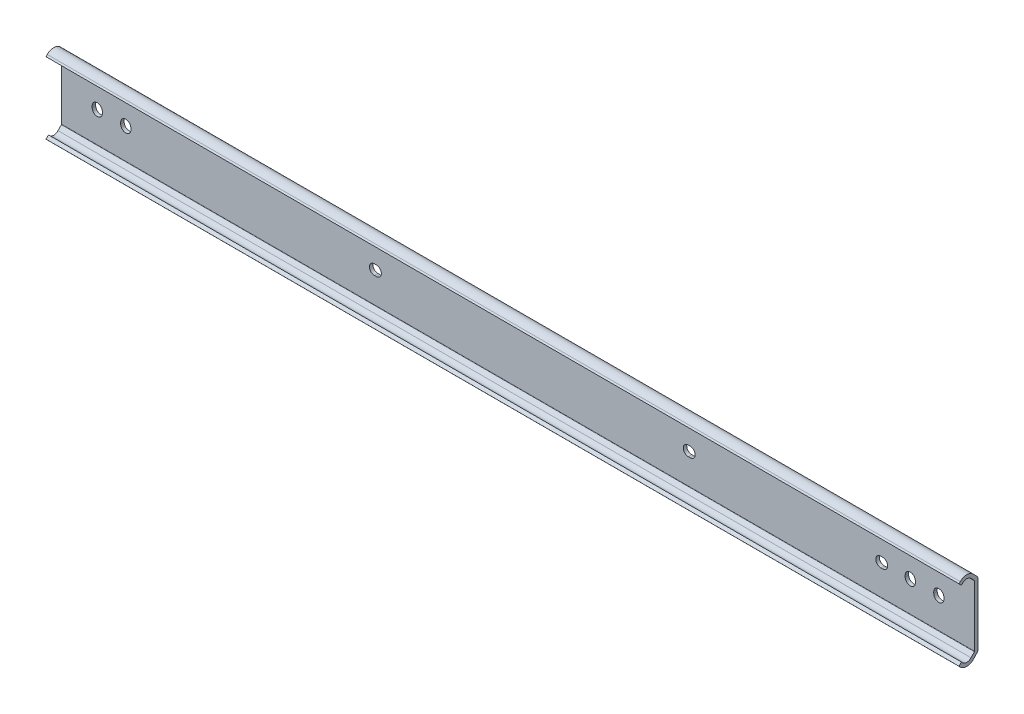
ISO-10303-21;
HEADER;
FILE_DESCRIPTION(('STEP AP214'),'2;1');
FILE_NAME('part.step','',(''),(''),'','','');
FILE_SCHEMA(('AUTOMOTIVE_DESIGN { 1 0 10303 214 1 1 1 1 }'));
ENDSEC;
DATA;
#1=APPLICATION_CONTEXT('core data for automotive mechanical design processes');
#2=APPLICATION_PROTOCOL_DEFINITION('international standard','automotive_design',2000,#1);
#3=PRODUCT_CONTEXT('',#1,'mechanical');
#4=PRODUCT('Part','Part','',(#3));
#5=PRODUCT_RELATED_PRODUCT_CATEGORY('part','',(#4));
#6=PRODUCT_DEFINITION_FORMATION('','',#4);
#7=PRODUCT_DEFINITION_CONTEXT('part definition',#1,'design');
#8=PRODUCT_DEFINITION('design','',#6,#7);
#9=PRODUCT_DEFINITION_SHAPE('','',#8);
#10=(LENGTH_UNIT() NAMED_UNIT(*) SI_UNIT(.MILLI.,.METRE.));
#11=(NAMED_UNIT(*) PLANE_ANGLE_UNIT() SI_UNIT($,.RADIAN.));
#12=(NAMED_UNIT(*) SI_UNIT($,.STERADIAN.) SOLID_ANGLE_UNIT());
#13=UNCERTAINTY_MEASURE_WITH_UNIT(LENGTH_MEASURE(1.E-05),#10,'distance_accuracy_value','');
#14=(GEOMETRIC_REPRESENTATION_CONTEXT(3) GLOBAL_UNCERTAINTY_ASSIGNED_CONTEXT((#13)) GLOBAL_UNIT_ASSIGNED_CONTEXT((#10,
#11,#12)) REPRESENTATION_CONTEXT('',''));
#15=CARTESIAN_POINT('',(0.,0.,0.));
#16=DIRECTION('',(0.,0.,1.));
#17=DIRECTION('',(1.,0.,0.));
#18=AXIS2_PLACEMENT_3D('',#15,#16,#17);
#19=CARTESIAN_POINT('',(-15.9,-13.5610180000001,0.));
#20=DIRECTION('',(0.,0.,-1.));
#21=DIRECTION('',(1.,0.,0.));
#22=AXIS2_PLACEMENT_3D('',#19,#20,#21);
#23=PLANE('',#22);
#24=DIRECTION('',(1.,0.,0.));
#25=VECTOR('',#24,1.);
#26=CARTESIAN_POINT('',(-15.9,13.561018,0.));
#27=LINE('',#26,#25);
#28=CARTESIAN_POINT('',(-15.9,13.561018,0.));
#29=VERTEX_POINT('',#28);
#30=CARTESIAN_POINT('',(390.5,13.561018,0.));
#31=VERTEX_POINT('',#30);
#32=EDGE_CURVE('E668',#29,#31,#27,.T.);
#33=ORIENTED_EDGE('',*,*,#32,.T.);
#34=DIRECTION('',(0.,1.,0.));
#35=VECTOR('',#34,1.);
#36=CARTESIAN_POINT('',(390.5,-13.5610180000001,0.));
#37=LINE('',#36,#35);
#38=CARTESIAN_POINT('',(390.5,-13.5610180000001,0.));
#39=VERTEX_POINT('',#38);
#40=EDGE_CURVE('E602',#39,#31,#37,.T.);
#41=ORIENTED_EDGE('',*,*,#40,.F.);
#42=DIRECTION('',(1.,0.,0.));
#43=VECTOR('',#42,1.);
#44=CARTESIAN_POINT('',(-15.9,-13.5610180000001,0.));
#45=LINE('',#44,#43);
#46=CARTESIAN_POINT('',(-15.9,-13.5610180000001,0.));
#47=VERTEX_POINT('',#46);
#48=EDGE_CURVE('E671',#47,#39,#45,.T.);
#49=ORIENTED_EDGE('',*,*,#48,.F.);
#50=DIRECTION('',(0.,1.,0.));
#51=VECTOR('',#50,1.);
#52=CARTESIAN_POINT('',(-15.9,-13.5610180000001,0.));
#53=LINE('',#52,#51);
#54=EDGE_CURVE('E659',#47,#29,#53,.T.);
#55=ORIENTED_EDGE('',*,*,#54,.T.);
#56=EDGE_LOOP('',(#33,#41,#49,#55));
#57=FACE_BOUND('',#56,.T.);
#58=CARTESIAN_POINT('',(263.9,0.,0.));
#59=DIRECTION('',(0.,0.,-1.));
#60=DIRECTION('',(1.,0.,0.));
#61=AXIS2_PLACEMENT_3D('',#58,#59,#60);
#62=CIRCLE('',#61,2.25);
#63=CARTESIAN_POINT('',(263.9,-2.25,0.));
#64=VERTEX_POINT('',#63);
#65=CARTESIAN_POINT('',(263.9,2.25,0.));
#66=VERTEX_POINT('',#65);
#67=EDGE_CURVE('E341',#64,#66,#62,.F.);
#68=ORIENTED_EDGE('',*,*,#67,.T.);
#69=DIRECTION('',(-1.,0.,0.));
#70=VECTOR('',#69,1.);
#71=CARTESIAN_POINT('',(263.9,2.25,0.));
#72=LINE('',#71,#70);
#73=CARTESIAN_POINT('',(263.1,2.25,0.));
#74=VERTEX_POINT('',#73);
#75=EDGE_CURVE('E353',#66,#74,#72,.T.);
#76=ORIENTED_EDGE('',*,*,#75,.T.);
#77=CARTESIAN_POINT('',(263.1,0.,0.));
#78=DIRECTION('',(0.,0.,-1.));
#79=DIRECTION('',(1.,0.,0.));
#80=AXIS2_PLACEMENT_3D('',#77,#78,#79);
#81=CIRCLE('',#80,2.25);
#82=CARTESIAN_POINT('',(263.1,-2.25,0.));
#83=VERTEX_POINT('',#82);
#84=EDGE_CURVE('E342',#74,#83,#81,.F.);
#85=ORIENTED_EDGE('',*,*,#84,.T.);
#86=DIRECTION('',(1.,0.,0.));
#87=VECTOR('',#86,1.);
#88=CARTESIAN_POINT('',(263.1,-2.25,0.));
#89=LINE('',#88,#87);
#90=EDGE_CURVE('E362',#83,#64,#89,.T.);
#91=ORIENTED_EDGE('',*,*,#90,.T.);
#92=EDGE_LOOP('',(#68,#76,#85,#91));
#93=FACE_BOUND('',#92,.T.);
#94=CARTESIAN_POINT('',(361.9,0.400000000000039,0.));
#95=DIRECTION('',(0.,0.,1.));
#96=DIRECTION('',(1.,0.,0.));
#97=AXIS2_PLACEMENT_3D('',#94,#95,#96);
#98=CIRCLE('',#97,2.24999999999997);
#99=CARTESIAN_POINT('',(364.15,0.400000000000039,0.));
#100=VERTEX_POINT('',#99);
#101=CARTESIAN_POINT('',(359.65,0.400000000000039,0.));
#102=VERTEX_POINT('',#101);
#103=EDGE_CURVE('E532',#100,#102,#98,.T.);
#104=ORIENTED_EDGE('',*,*,#103,.T.);
#105=DIRECTION('',(0.,-1.,0.));
#106=VECTOR('',#105,1.);
#107=CARTESIAN_POINT('',(359.65,0.400000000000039,0.));
#108=LINE('',#107,#106);
#109=CARTESIAN_POINT('',(359.65,-0.400000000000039,0.));
#110=VERTEX_POINT('',#109);
#111=EDGE_CURVE('E535',#102,#110,#108,.T.);
#112=ORIENTED_EDGE('',*,*,#111,.T.);
#113=CARTESIAN_POINT('',(361.9,-0.400000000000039,0.));
#114=DIRECTION('',(0.,0.,1.));
#115=DIRECTION('',(1.,0.,0.));
#116=AXIS2_PLACEMENT_3D('',#113,#114,#115);
#117=CIRCLE('',#116,2.24999999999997);
#118=CARTESIAN_POINT('',(364.15,-0.400000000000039,0.));
#119=VERTEX_POINT('',#118);
#120=EDGE_CURVE('E538',#110,#119,#117,.T.);
#121=ORIENTED_EDGE('',*,*,#120,.T.);
#122=DIRECTION('',(0.,1.,0.));
#123=VECTOR('',#122,1.);
#124=CARTESIAN_POINT('',(364.15,0.400000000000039,0.));
#125=LINE('',#124,#123);
#126=EDGE_CURVE('E541',#119,#100,#125,.T.);
#127=ORIENTED_EDGE('',*,*,#126,.T.);
#128=EDGE_LOOP('',(#104,#112,#121,#127));
#129=FACE_BOUND('',#128,.T.);
#130=CARTESIAN_POINT('',(374.6,0.400000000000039,0.));
#131=DIRECTION('',(0.,0.,1.));
#132=DIRECTION('',(1.,0.,0.));
#133=AXIS2_PLACEMENT_3D('',#130,#131,#132);
#134=CIRCLE('',#133,2.24999999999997);
#135=CARTESIAN_POINT('',(376.85,0.400000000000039,0.));
#136=VERTEX_POINT('',#135);
#137=CARTESIAN_POINT('',(372.35,0.400000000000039,0.));
#138=VERTEX_POINT('',#137);
#139=EDGE_CURVE('E500',#136,#138,#134,.T.);
#140=ORIENTED_EDGE('',*,*,#139,.T.);
#141=DIRECTION('',(0.,-1.,0.));
#142=VECTOR('',#141,1.);
#143=CARTESIAN_POINT('',(372.35,0.400000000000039,0.));
#144=LINE('',#143,#142);
#145=CARTESIAN_POINT('',(372.35,-0.400000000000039,0.));
#146=VERTEX_POINT('',#145);
#147=EDGE_CURVE('E503',#138,#146,#144,.T.);
#148=ORIENTED_EDGE('',*,*,#147,.T.);
#149=CARTESIAN_POINT('',(374.6,-0.400000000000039,0.));
#150=DIRECTION('',(0.,0.,1.));
#151=DIRECTION('',(1.,0.,0.));
#152=AXIS2_PLACEMENT_3D('',#149,#150,#151);
#153=CIRCLE('',#152,2.24999999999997);
#154=CARTESIAN_POINT('',(376.85,-0.400000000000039,0.));
#155=VERTEX_POINT('',#154);
#156=EDGE_CURVE('E506',#146,#155,#153,.T.);
#157=ORIENTED_EDGE('',*,*,#156,.T.);
#158=DIRECTION('',(0.,1.,0.));
#159=VECTOR('',#158,1.);
#160=CARTESIAN_POINT('',(376.85,0.400000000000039,0.));
#161=LINE('',#160,#159);
#162=EDGE_CURVE('E509',#155,#136,#161,.T.);
#163=ORIENTED_EDGE('',*,*,#162,.T.);
#164=EDGE_LOOP('',(#140,#148,#157,#163));
#165=FACE_BOUND('',#164,.T.);
#166=CARTESIAN_POINT('',(0.,0.400000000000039,0.));
#167=DIRECTION('',(0.,0.,1.));
#168=DIRECTION('',(1.,0.,0.));
#169=AXIS2_PLACEMENT_3D('',#166,#167,#168);
#170=CIRCLE('',#169,2.24999999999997);
#171=CARTESIAN_POINT('',(2.25000000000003,0.400000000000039,0.));
#172=VERTEX_POINT('',#171);
#173=CARTESIAN_POINT('',(-2.24999999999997,0.400000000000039,0.));
#174=VERTEX_POINT('',#173);
#175=EDGE_CURVE('E468',#172,#174,#170,.T.);
#176=ORIENTED_EDGE('',*,*,#175,.T.);
#177=DIRECTION('',(0.,-1.,0.));
#178=VECTOR('',#177,1.);
#179=CARTESIAN_POINT('',(-2.24999999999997,0.400000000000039,0.));
#180=LINE('',#179,#178);
#181=CARTESIAN_POINT('',(-2.24999999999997,-0.400000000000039,0.));
#182=VERTEX_POINT('',#181);
#183=EDGE_CURVE('E471',#174,#182,#180,.T.);
#184=ORIENTED_EDGE('',*,*,#183,.T.);
#185=CARTESIAN_POINT('',(0.,-0.400000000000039,0.));
#186=DIRECTION('',(0.,0.,1.));
#187=DIRECTION('',(1.,0.,0.));
#188=AXIS2_PLACEMENT_3D('',#185,#186,#187);
#189=CIRCLE('',#188,2.24999999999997);
#190=CARTESIAN_POINT('',(2.25000000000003,-0.400000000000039,0.));
#191=VERTEX_POINT('',#190);
#192=EDGE_CURVE('E474',#182,#191,#189,.T.);
#193=ORIENTED_EDGE('',*,*,#192,.T.);
#194=DIRECTION('',(0.,1.,0.));
#195=VECTOR('',#194,1.);
#196=CARTESIAN_POINT('',(2.25000000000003,0.400000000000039,0.));
#197=LINE('',#196,#195);
#198=EDGE_CURVE('E477',#191,#172,#197,.T.);
#199=ORIENTED_EDGE('',*,*,#198,.T.);
#200=EDGE_LOOP('',(#176,#184,#193,#199));
#201=FACE_BOUND('',#200,.T.);
#202=CARTESIAN_POINT('',(349.6,0.,0.));
#203=DIRECTION('',(0.,0.,1.));
#204=DIRECTION('',(1.,0.,0.));
#205=AXIS2_PLACEMENT_3D('',#202,#203,#204);
#206=CIRCLE('',#205,2.25);
#207=CARTESIAN_POINT('',(349.6,-2.25,0.));
#208=VERTEX_POINT('',#207);
#209=CARTESIAN_POINT('',(349.6,2.25,0.));
#210=VERTEX_POINT('',#209);
#211=EDGE_CURVE('E436',#208,#210,#206,.T.);
#212=ORIENTED_EDGE('',*,*,#211,.T.);
#213=DIRECTION('',(-1.,0.,0.));
#214=VECTOR('',#213,1.);
#215=CARTESIAN_POINT('',(349.6,2.25,0.));
#216=LINE('',#215,#214);
#217=CARTESIAN_POINT('',(348.8,2.25,0.));
#218=VERTEX_POINT('',#217);
#219=EDGE_CURVE('E439',#210,#218,#216,.T.);
#220=ORIENTED_EDGE('',*,*,#219,.T.);
#221=CARTESIAN_POINT('',(348.8,0.,0.));
#222=DIRECTION('',(0.,0.,1.));
#223=DIRECTION('',(1.,0.,0.));
#224=AXIS2_PLACEMENT_3D('',#221,#222,#223);
#225=CIRCLE('',#224,2.25);
#226=CARTESIAN_POINT('',(348.8,-2.25,0.));
#227=VERTEX_POINT('',#226);
#228=EDGE_CURVE('E442',#218,#227,#225,.T.);
#229=ORIENTED_EDGE('',*,*,#228,.T.);
#230=DIRECTION('',(1.,0.,0.));
#231=VECTOR('',#230,1.);
#232=CARTESIAN_POINT('',(349.6,-2.25,0.));
#233=LINE('',#232,#231);
#234=EDGE_CURVE('E445',#227,#208,#233,.T.);
#235=ORIENTED_EDGE('',*,*,#234,.T.);
#236=EDGE_LOOP('',(#212,#220,#229,#235));
#237=FACE_BOUND('',#236,.T.);
#238=CARTESIAN_POINT('',(12.7,0.400000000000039,0.));
#239=DIRECTION('',(0.,0.,1.));
#240=DIRECTION('',(1.,0.,0.));
#241=AXIS2_PLACEMENT_3D('',#238,#239,#240);
#242=CIRCLE('',#241,2.24999999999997);
#243=CARTESIAN_POINT('',(14.95,0.400000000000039,0.));
#244=VERTEX_POINT('',#243);
#245=CARTESIAN_POINT('',(10.45,0.400000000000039,0.));
#246=VERTEX_POINT('',#245);
#247=EDGE_CURVE('E404',#244,#246,#242,.T.);
#248=ORIENTED_EDGE('',*,*,#247,.T.);
#249=DIRECTION('',(0.,-1.,0.));
#250=VECTOR('',#249,1.);
#251=CARTESIAN_POINT('',(10.45,0.400000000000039,0.));
#252=LINE('',#251,#250);
#253=CARTESIAN_POINT('',(10.45,-0.400000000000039,0.));
#254=VERTEX_POINT('',#253);
#255=EDGE_CURVE('E407',#246,#254,#252,.T.);
#256=ORIENTED_EDGE('',*,*,#255,.T.);
#257=CARTESIAN_POINT('',(12.7,-0.400000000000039,0.));
#258=DIRECTION('',(0.,0.,1.));
#259=DIRECTION('',(1.,0.,0.));
#260=AXIS2_PLACEMENT_3D('',#257,#258,#259);
#261=CIRCLE('',#260,2.24999999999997);
#262=CARTESIAN_POINT('',(14.95,-0.400000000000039,0.));
#263=VERTEX_POINT('',#262);
#264=EDGE_CURVE('E410',#254,#263,#261,.T.);
#265=ORIENTED_EDGE('',*,*,#264,.T.);
#266=DIRECTION('',(0.,1.,0.));
#267=VECTOR('',#266,1.);
#268=CARTESIAN_POINT('',(14.95,0.400000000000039,0.));
#269=LINE('',#268,#267);
#270=EDGE_CURVE('E413',#263,#244,#269,.T.);
#271=ORIENTED_EDGE('',*,*,#270,.T.);
#272=EDGE_LOOP('',(#248,#256,#265,#271));
#273=FACE_BOUND('',#272,.T.);
#274=CARTESIAN_POINT('',(124.2,0.,0.));
#275=DIRECTION('',(0.,0.,1.));
#276=DIRECTION('',(1.,0.,0.));
#277=AXIS2_PLACEMENT_3D('',#274,#275,#276);
#278=CIRCLE('',#277,2.25);
#279=CARTESIAN_POINT('',(124.2,-2.24999999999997,0.));
#280=VERTEX_POINT('',#279);
#281=CARTESIAN_POINT('',(124.2,2.25000000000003,0.));
#282=VERTEX_POINT('',#281);
#283=EDGE_CURVE('E375',#280,#282,#278,.T.);
#284=ORIENTED_EDGE('',*,*,#283,.T.);
#285=DIRECTION('',(-1.,0.,0.));
#286=VECTOR('',#285,1.);
#287=CARTESIAN_POINT('',(124.2,2.25000000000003,0.));
#288=LINE('',#287,#286);
#289=CARTESIAN_POINT('',(123.4,2.25000000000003,0.));
#290=VERTEX_POINT('',#289);
#291=EDGE_CURVE('E378',#282,#290,#288,.T.);
#292=ORIENTED_EDGE('',*,*,#291,.T.);
#293=CARTESIAN_POINT('',(123.4,0.,0.));
#294=DIRECTION('',(0.,0.,1.));
#295=DIRECTION('',(1.,0.,0.));
#296=AXIS2_PLACEMENT_3D('',#293,#294,#295);
#297=CIRCLE('',#296,2.25);
#298=CARTESIAN_POINT('',(123.4,-2.24999999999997,0.));
#299=VERTEX_POINT('',#298);
#300=EDGE_CURVE('E31',#290,#299,#297,.T.);
#301=ORIENTED_EDGE('',*,*,#300,.T.);
#302=DIRECTION('',(1.,0.,0.));
#303=VECTOR('',#302,1.);
#304=CARTESIAN_POINT('',(124.2,-2.24999999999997,0.));
#305=LINE('',#304,#303);
#306=EDGE_CURVE('E382',#299,#280,#305,.T.);
#307=ORIENTED_EDGE('',*,*,#306,.T.);
#308=EDGE_LOOP('',(#284,#292,#301,#307));
#309=FACE_BOUND('',#308,.T.);
#310=ADVANCED_FACE('F14',(#57,#93,#129,#165,#201,#237,#273,#309),#23,.T.);
#311=CARTESIAN_POINT('',(-15.9,13.561018,1.54999999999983));
#312=DIRECTION('',(0.,0.,1.));
#313=DIRECTION('',(-1.,0.,0.));
#314=AXIS2_PLACEMENT_3D('',#311,#312,#313);
#315=PLANE('',#314);
#316=DIRECTION('',(1.,0.,0.));
#317=VECTOR('',#316,1.);
#318=CARTESIAN_POINT('',(-15.9,-13.5610180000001,1.54999999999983));
#319=LINE('',#318,#317);
#320=CARTESIAN_POINT('',(-15.9,-13.5610180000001,1.54999999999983));
#321=VERTEX_POINT('',#320);
#322=CARTESIAN_POINT('',(390.5,-13.5610180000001,1.54999999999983));
#323=VERTEX_POINT('',#322);
#324=EDGE_CURVE('E690',#321,#323,#319,.T.);
#325=ORIENTED_EDGE('',*,*,#324,.T.);
#326=DIRECTION('',(0.,-1.,0.));
#327=VECTOR('',#326,1.);
#328=CARTESIAN_POINT('',(390.5,13.561018,1.54999999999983));
#329=LINE('',#328,#327);
#330=CARTESIAN_POINT('',(390.5,13.561018,1.54999999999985));
#331=VERTEX_POINT('',#330);
#332=EDGE_CURVE('E574',#331,#323,#329,.T.);
#333=ORIENTED_EDGE('',*,*,#332,.F.);
#334=DIRECTION('',(1.,0.,0.));
#335=VECTOR('',#334,1.);
#336=CARTESIAN_POINT('',(-15.9,13.561018,1.54999999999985));
#337=LINE('',#336,#335);
#338=CARTESIAN_POINT('',(-15.9,13.561018,1.54999999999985));
#339=VERTEX_POINT('',#338);
#340=EDGE_CURVE('E693',#339,#331,#337,.T.);
#341=ORIENTED_EDGE('',*,*,#340,.F.);
#342=DIRECTION('',(0.,-1.,0.));
#343=VECTOR('',#342,1.);
#344=CARTESIAN_POINT('',(-15.9,13.561018,1.54999999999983));
#345=LINE('',#344,#343);
#346=EDGE_CURVE('E630',#339,#321,#345,.T.);
#347=ORIENTED_EDGE('',*,*,#346,.T.);
#348=EDGE_LOOP('',(#325,#333,#341,#347));
#349=FACE_BOUND('',#348,.T.);
#350=DIRECTION('',(-1.,0.,0.));
#351=VECTOR('',#350,1.);
#352=CARTESIAN_POINT('',(263.9,2.25,1.54999999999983));
#353=LINE('',#352,#351);
#354=CARTESIAN_POINT('',(263.9,2.25,1.54999999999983));
#355=VERTEX_POINT('',#354);
#356=CARTESIAN_POINT('',(263.1,2.25,1.54999999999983));
#357=VERTEX_POINT('',#356);
#358=EDGE_CURVE('E332',#355,#357,#353,.T.);
#359=ORIENTED_EDGE('',*,*,#358,.F.);
#360=CARTESIAN_POINT('',(263.9,0.,1.54999999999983));
#361=DIRECTION('',(0.,0.,1.));
#362=DIRECTION('',(-1.,0.,0.));
#363=AXIS2_PLACEMENT_3D('',#360,#361,#362);
#364=CIRCLE('',#363,2.25);
#365=CARTESIAN_POINT('',(263.9,-2.25,1.54999999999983));
#366=VERTEX_POINT('',#365);
#367=EDGE_CURVE('E339',#366,#355,#364,.T.);
#368=ORIENTED_EDGE('',*,*,#367,.F.);
#369=DIRECTION('',(1.,0.,0.));
#370=VECTOR('',#369,1.);
#371=CARTESIAN_POINT('',(263.1,-2.25,1.54999999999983));
#372=LINE('',#371,#370);
#373=CARTESIAN_POINT('',(263.1,-2.25,1.54999999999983));
#374=VERTEX_POINT('',#373);
#375=EDGE_CURVE('E321',#374,#366,#372,.T.);
#376=ORIENTED_EDGE('',*,*,#375,.F.);
#377=CARTESIAN_POINT('',(263.1,0.,1.54999999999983));
#378=DIRECTION('',(0.,0.,1.));
#379=DIRECTION('',(-1.,0.,0.));
#380=AXIS2_PLACEMENT_3D('',#377,#378,#379);
#381=CIRCLE('',#380,2.25);
#382=EDGE_CURVE('E333',#357,#374,#381,.T.);
#383=ORIENTED_EDGE('',*,*,#382,.F.);
#384=EDGE_LOOP('',(#359,#368,#376,#383));
#385=FACE_BOUND('',#384,.T.);
#386=CARTESIAN_POINT('',(361.9,0.400000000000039,1.54999999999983));
#387=DIRECTION('',(0.,0.,1.));
#388=DIRECTION('',(1.,0.,0.));
#389=AXIS2_PLACEMENT_3D('',#386,#387,#388);
#390=CIRCLE('',#389,2.24999999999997);
#391=CARTESIAN_POINT('',(364.15,0.400000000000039,1.54999999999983));
#392=VERTEX_POINT('',#391);
#393=CARTESIAN_POINT('',(359.65,0.400000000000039,1.54999999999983));
#394=VERTEX_POINT('',#393);
#395=EDGE_CURVE('E515',#392,#394,#390,.T.);
#396=ORIENTED_EDGE('',*,*,#395,.F.);
#397=DIRECTION('',(0.,1.,0.));
#398=VECTOR('',#397,1.);
#399=CARTESIAN_POINT('',(364.15,0.400000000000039,1.54999999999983));
#400=LINE('',#399,#398);
#401=CARTESIAN_POINT('',(364.15,-0.400000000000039,1.54999999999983));
#402=VERTEX_POINT('',#401);
#403=EDGE_CURVE('E529',#402,#392,#400,.T.);
#404=ORIENTED_EDGE('',*,*,#403,.F.);
#405=CARTESIAN_POINT('',(361.9,-0.400000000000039,1.54999999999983));
#406=DIRECTION('',(0.,0.,1.));
#407=DIRECTION('',(1.,0.,0.));
#408=AXIS2_PLACEMENT_3D('',#405,#406,#407);
#409=CIRCLE('',#408,2.24999999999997);
#410=CARTESIAN_POINT('',(359.65,-0.40000000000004,1.54999999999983));
#411=VERTEX_POINT('',#410);
#412=EDGE_CURVE('E526',#411,#402,#409,.T.);
#413=ORIENTED_EDGE('',*,*,#412,.F.);
#414=DIRECTION('',(0.,-1.,0.));
#415=VECTOR('',#414,1.);
#416=CARTESIAN_POINT('',(359.65,0.400000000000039,1.54999999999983));
#417=LINE('',#416,#415);
#418=EDGE_CURVE('E523',#394,#411,#417,.T.);
#419=ORIENTED_EDGE('',*,*,#418,.F.);
#420=EDGE_LOOP('',(#396,#404,#413,#419));
#421=FACE_BOUND('',#420,.T.);
#422=CARTESIAN_POINT('',(374.6,0.400000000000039,1.54999999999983));
#423=DIRECTION('',(0.,0.,1.));
#424=DIRECTION('',(1.,0.,0.));
#425=AXIS2_PLACEMENT_3D('',#422,#423,#424);
#426=CIRCLE('',#425,2.24999999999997);
#427=CARTESIAN_POINT('',(376.85,0.400000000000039,1.54999999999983));
#428=VERTEX_POINT('',#427);
#429=CARTESIAN_POINT('',(372.35,0.400000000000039,1.54999999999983));
#430=VERTEX_POINT('',#429);
#431=EDGE_CURVE('E483',#428,#430,#426,.T.);
#432=ORIENTED_EDGE('',*,*,#431,.F.);
#433=DIRECTION('',(0.,1.,0.));
#434=VECTOR('',#433,1.);
#435=CARTESIAN_POINT('',(376.85,0.400000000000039,1.54999999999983));
#436=LINE('',#435,#434);
#437=CARTESIAN_POINT('',(376.85,-0.400000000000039,1.54999999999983));
#438=VERTEX_POINT('',#437);
#439=EDGE_CURVE('E497',#438,#428,#436,.T.);
#440=ORIENTED_EDGE('',*,*,#439,.F.);
#441=CARTESIAN_POINT('',(374.6,-0.400000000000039,1.54999999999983));
#442=DIRECTION('',(0.,0.,1.));
#443=DIRECTION('',(1.,0.,0.));
#444=AXIS2_PLACEMENT_3D('',#441,#442,#443);
#445=CIRCLE('',#444,2.24999999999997);
#446=CARTESIAN_POINT('',(372.35,-0.40000000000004,1.54999999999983));
#447=VERTEX_POINT('',#446);
#448=EDGE_CURVE('E494',#447,#438,#445,.T.);
#449=ORIENTED_EDGE('',*,*,#448,.F.);
#450=DIRECTION('',(0.,-1.,0.));
#451=VECTOR('',#450,1.);
#452=CARTESIAN_POINT('',(372.35,0.400000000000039,1.54999999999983));
#453=LINE('',#452,#451);
#454=EDGE_CURVE('E491',#430,#447,#453,.T.);
#455=ORIENTED_EDGE('',*,*,#454,.F.);
#456=EDGE_LOOP('',(#432,#440,#449,#455));
#457=FACE_BOUND('',#456,.T.);
#458=CARTESIAN_POINT('',(0.,0.400000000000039,1.54999999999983));
#459=DIRECTION('',(0.,0.,1.));
#460=DIRECTION('',(1.,0.,0.));
#461=AXIS2_PLACEMENT_3D('',#458,#459,#460);
#462=CIRCLE('',#461,2.24999999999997);
#463=CARTESIAN_POINT('',(2.25000000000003,0.400000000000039,1.54999999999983));
#464=VERTEX_POINT('',#463);
#465=CARTESIAN_POINT('',(-2.24999999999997,0.400000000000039,1.54999999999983));
#466=VERTEX_POINT('',#465);
#467=EDGE_CURVE('E451',#464,#466,#462,.T.);
#468=ORIENTED_EDGE('',*,*,#467,.F.);
#469=DIRECTION('',(0.,1.,0.));
#470=VECTOR('',#469,1.);
#471=CARTESIAN_POINT('',(2.25000000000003,0.400000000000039,1.54999999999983));
#472=LINE('',#471,#470);
#473=CARTESIAN_POINT('',(2.25000000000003,-0.400000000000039,1.54999999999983));
#474=VERTEX_POINT('',#473);
#475=EDGE_CURVE('E465',#474,#464,#472,.T.);
#476=ORIENTED_EDGE('',*,*,#475,.F.);
#477=CARTESIAN_POINT('',(0.,-0.400000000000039,1.54999999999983));
#478=DIRECTION('',(0.,0.,1.));
#479=DIRECTION('',(1.,0.,0.));
#480=AXIS2_PLACEMENT_3D('',#477,#478,#479);
#481=CIRCLE('',#480,2.24999999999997);
#482=CARTESIAN_POINT('',(-2.24999999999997,-0.40000000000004,1.54999999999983));
#483=VERTEX_POINT('',#482);
#484=EDGE_CURVE('E462',#483,#474,#481,.T.);
#485=ORIENTED_EDGE('',*,*,#484,.F.);
#486=DIRECTION('',(0.,-1.,0.));
#487=VECTOR('',#486,1.);
#488=CARTESIAN_POINT('',(-2.24999999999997,0.400000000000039,1.54999999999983));
#489=LINE('',#488,#487);
#490=EDGE_CURVE('E459',#466,#483,#489,.T.);
#491=ORIENTED_EDGE('',*,*,#490,.F.);
#492=EDGE_LOOP('',(#468,#476,#485,#491));
#493=FACE_BOUND('',#492,.T.);
#494=CARTESIAN_POINT('',(349.6,0.,1.54999999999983));
#495=DIRECTION('',(0.,0.,1.));
#496=DIRECTION('',(1.,0.,0.));
#497=AXIS2_PLACEMENT_3D('',#494,#495,#496);
#498=CIRCLE('',#497,2.25);
#499=CARTESIAN_POINT('',(349.6,-2.25,1.54999999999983));
#500=VERTEX_POINT('',#499);
#501=CARTESIAN_POINT('',(349.6,2.25,1.54999999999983));
#502=VERTEX_POINT('',#501);
#503=EDGE_CURVE('E419',#500,#502,#498,.T.);
#504=ORIENTED_EDGE('',*,*,#503,.F.);
#505=DIRECTION('',(1.,0.,0.));
#506=VECTOR('',#505,1.);
#507=CARTESIAN_POINT('',(349.6,-2.25,1.54999999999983));
#508=LINE('',#507,#506);
#509=CARTESIAN_POINT('',(348.8,-2.25,1.54999999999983));
#510=VERTEX_POINT('',#509);
#511=EDGE_CURVE('E433',#510,#500,#508,.T.);
#512=ORIENTED_EDGE('',*,*,#511,.F.);
#513=CARTESIAN_POINT('',(348.8,0.,1.54999999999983));
#514=DIRECTION('',(0.,0.,1.));
#515=DIRECTION('',(1.,0.,0.));
#516=AXIS2_PLACEMENT_3D('',#513,#514,#515);
#517=CIRCLE('',#516,2.25);
#518=CARTESIAN_POINT('',(348.8,2.25,1.54999999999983));
#519=VERTEX_POINT('',#518);
#520=EDGE_CURVE('E430',#519,#510,#517,.T.);
#521=ORIENTED_EDGE('',*,*,#520,.F.);
#522=DIRECTION('',(-1.,0.,0.));
#523=VECTOR('',#522,1.);
#524=CARTESIAN_POINT('',(349.6,2.25,1.54999999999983));
#525=LINE('',#524,#523);
#526=EDGE_CURVE('E427',#502,#519,#525,.T.);
#527=ORIENTED_EDGE('',*,*,#526,.F.);
#528=EDGE_LOOP('',(#504,#512,#521,#527));
#529=FACE_BOUND('',#528,.T.);
#530=CARTESIAN_POINT('',(12.7,0.400000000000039,1.54999999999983));
#531=DIRECTION('',(0.,0.,1.));
#532=DIRECTION('',(1.,0.,0.));
#533=AXIS2_PLACEMENT_3D('',#530,#531,#532);
#534=CIRCLE('',#533,2.24999999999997);
#535=CARTESIAN_POINT('',(14.95,0.400000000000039,1.54999999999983));
#536=VERTEX_POINT('',#535);
#537=CARTESIAN_POINT('',(10.45,0.400000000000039,1.54999999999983));
#538=VERTEX_POINT('',#537);
#539=EDGE_CURVE('E388',#536,#538,#534,.T.);
#540=ORIENTED_EDGE('',*,*,#539,.F.);
#541=DIRECTION('',(0.,1.,0.));
#542=VECTOR('',#541,1.);
#543=CARTESIAN_POINT('',(14.95,0.400000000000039,1.54999999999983));
#544=LINE('',#543,#542);
#545=CARTESIAN_POINT('',(14.95,-0.400000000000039,1.54999999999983));
#546=VERTEX_POINT('',#545);
#547=EDGE_CURVE('E401',#546,#536,#544,.T.);
#548=ORIENTED_EDGE('',*,*,#547,.F.);
#549=CARTESIAN_POINT('',(12.7,-0.400000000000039,1.54999999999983));
#550=DIRECTION('',(0.,0.,1.));
#551=DIRECTION('',(1.,0.,0.));
#552=AXIS2_PLACEMENT_3D('',#549,#550,#551);
#553=CIRCLE('',#552,2.24999999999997);
#554=CARTESIAN_POINT('',(10.45,-0.40000000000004,1.54999999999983));
#555=VERTEX_POINT('',#554);
#556=EDGE_CURVE('E398',#555,#546,#553,.T.);
#557=ORIENTED_EDGE('',*,*,#556,.F.);
#558=DIRECTION('',(0.,-1.,0.));
#559=VECTOR('',#558,1.);
#560=CARTESIAN_POINT('',(10.45,0.400000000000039,1.54999999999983));
#561=LINE('',#560,#559);
#562=EDGE_CURVE('E395',#538,#555,#561,.T.);
#563=ORIENTED_EDGE('',*,*,#562,.F.);
#564=EDGE_LOOP('',(#540,#548,#557,#563));
#565=FACE_BOUND('',#564,.T.);
#566=CARTESIAN_POINT('',(124.2,0.,1.54999999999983));
#567=DIRECTION('',(0.,0.,1.));
#568=DIRECTION('',(1.,0.,0.));
#569=AXIS2_PLACEMENT_3D('',#566,#567,#568);
#570=CIRCLE('',#569,2.25);
#571=CARTESIAN_POINT('',(124.2,-2.24999999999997,1.54999999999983));
#572=VERTEX_POINT('',#571);
#573=CARTESIAN_POINT('',(124.2,2.25000000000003,1.54999999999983));
#574=VERTEX_POINT('',#573);
#575=EDGE_CURVE('E39',#572,#574,#570,.T.);
#576=ORIENTED_EDGE('',*,*,#575,.F.);
#577=DIRECTION('',(1.,0.,0.));
#578=VECTOR('',#577,1.);
#579=CARTESIAN_POINT('',(124.2,-2.24999999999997,1.54999999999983));
#580=LINE('',#579,#578);
#581=CARTESIAN_POINT('',(123.4,-2.24999999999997,1.54999999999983));
#582=VERTEX_POINT('',#581);
#583=EDGE_CURVE('E372',#582,#572,#580,.T.);
#584=ORIENTED_EDGE('',*,*,#583,.F.);
#585=CARTESIAN_POINT('',(123.4,0.,1.54999999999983));
#586=DIRECTION('',(0.,0.,1.));
#587=DIRECTION('',(1.,0.,0.));
#588=AXIS2_PLACEMENT_3D('',#585,#586,#587);
#589=CIRCLE('',#588,2.25);
#590=CARTESIAN_POINT('',(123.4,2.25000000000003,1.54999999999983));
#591=VERTEX_POINT('',#590);
#592=EDGE_CURVE('E369',#591,#582,#589,.T.);
#593=ORIENTED_EDGE('',*,*,#592,.F.);
#594=DIRECTION('',(-1.,0.,0.));
#595=VECTOR('',#594,1.);
#596=CARTESIAN_POINT('',(124.2,2.25000000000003,1.54999999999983));
#597=LINE('',#596,#595);
#598=EDGE_CURVE('E366',#574,#591,#597,.T.);
#599=ORIENTED_EDGE('',*,*,#598,.F.);
#600=EDGE_LOOP('',(#576,#584,#593,#599));
#601=FACE_BOUND('',#600,.T.);
#602=ADVANCED_FACE('F345',(#349,#385,#421,#457,#493,#529,#565,#601),#315,.T.);
#603=CARTESIAN_POINT('',(390.5,13.575,5.00000000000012));
#604=DIRECTION('',(-1.,0.,0.));
#605=DIRECTION('',(0.,0.,-1.));
#606=AXIS2_PLACEMENT_3D('',#603,#604,#605);
#607=PLANE('',#606);
#608=ORIENTED_EDGE('',*,*,#40,.T.);
#609=CARTESIAN_POINT('',(390.5,13.5610179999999,1.80000000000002));
#610=DIRECTION('',(1.,0.,0.));
#611=DIRECTION('',(0.,0.,-1.));
#612=AXIS2_PLACEMENT_3D('',#609,#610,#611);
#613=CIRCLE('',#612,1.8);
#614=CARTESIAN_POINT('',(390.5,14.8073560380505,0.501292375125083));
#615=VERTEX_POINT('',#614);
#616=EDGE_CURVE('E604',#31,#615,#613,.T.);
#617=ORIENTED_EDGE('',*,*,#616,.T.);
#618=DIRECTION('',(0.,0.721504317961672,0.692409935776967));
#619=VECTOR('',#618,1.);
#620=CARTESIAN_POINT('',(390.5,14.8073560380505,0.501292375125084));
#621=LINE('',#620,#619);
#622=CARTESIAN_POINT('',(390.5,16.4741282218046,2.10085261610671));
#623=VERTEX_POINT('',#622);
#624=EDGE_CURVE('E607',#615,#623,#621,.T.);
#625=ORIENTED_EDGE('',*,*,#624,.T.);
#626=CARTESIAN_POINT('',(390.5,13.575,5.00000000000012));
#627=DIRECTION('',(1.,0.,0.));
#628=DIRECTION('',(0.,0.,-1.));
#629=AXIS2_PLACEMENT_3D('',#626,#627,#628);
#630=CIRCLE('',#629,4.1);
#631=CARTESIAN_POINT('',(390.5,16.4741282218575,7.89914738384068));
#632=VERTEX_POINT('',#631);
#633=EDGE_CURVE('E547',#623,#632,#630,.T.);
#634=ORIENTED_EDGE('',*,*,#633,.T.);
#635=DIRECTION('',(0.,-0.721504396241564,0.692409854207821));
#636=VECTOR('',#635,1.);
#637=CARTESIAN_POINT('',(390.5,15.8897090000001,8.45999999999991));
#638=LINE('',#637,#636);
#639=CARTESIAN_POINT('',(390.5,15.8897090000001,8.45999999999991));
#640=VERTEX_POINT('',#639);
#641=EDGE_CURVE('E556',#632,#640,#638,.T.);
#642=ORIENTED_EDGE('',*,*,#641,.T.);
#643=DIRECTION('',(0.,-0.707106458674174,-0.707107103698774));
#644=VECTOR('',#643,1.);
#645=CARTESIAN_POINT('',(390.5,14.793462,7.363752));
#646=LINE('',#645,#644);
#647=CARTESIAN_POINT('',(390.5,14.793462,7.363752));
#648=VERTEX_POINT('',#647);
#649=EDGE_CURVE('E559',#640,#648,#646,.T.);
#650=ORIENTED_EDGE('',*,*,#649,.T.);
#651=DIRECTION('',(0.,0.721503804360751,-0.692410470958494));
#652=VECTOR('',#651,1.);
#653=CARTESIAN_POINT('',(390.5,15.3880487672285,6.79314086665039));
#654=LINE('',#653,#652);
#655=CARTESIAN_POINT('',(390.5,15.3880487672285,6.79314086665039));
#656=VERTEX_POINT('',#655);
#657=EDGE_CURVE('E562',#648,#656,#654,.T.);
#658=ORIENTED_EDGE('',*,*,#657,.T.);
#659=CARTESIAN_POINT('',(390.5,13.575,5.00000000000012));
#660=DIRECTION('',(-1.,0.,0.));
#661=DIRECTION('',(0.,0.,1.));
#662=AXIS2_PLACEMENT_3D('',#659,#660,#661);
#663=CIRCLE('',#662,2.55);
#664=CARTESIAN_POINT('',(390.5,15.2920682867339,3.11474762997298));
#665=VERTEX_POINT('',#664);
#666=EDGE_CURVE('E565',#656,#665,#663,.T.);
#667=ORIENTED_EDGE('',*,*,#666,.T.);
#668=DIRECTION('',(0.,-0.721504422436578,-0.692409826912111));
#669=VECTOR('',#668,1.);
#670=CARTESIAN_POINT('',(390.5,13.7341205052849,1.61962394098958));
#671=LINE('',#670,#669);
#672=CARTESIAN_POINT('',(390.5,13.7341205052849,1.61962394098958));
#673=VERTEX_POINT('',#672);
#674=EDGE_CURVE('E568',#665,#673,#671,.T.);
#675=ORIENTED_EDGE('',*,*,#674,.T.);
#676=CARTESIAN_POINT('',(390.5,13.5610179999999,1.80000000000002));
#677=DIRECTION('',(-1.,0.,0.));
#678=DIRECTION('',(0.,0.,1.));
#679=AXIS2_PLACEMENT_3D('',#676,#677,#678);
#680=CIRCLE('',#679,0.250000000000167);
#681=EDGE_CURVE('E571',#673,#331,#680,.T.);
#682=ORIENTED_EDGE('',*,*,#681,.T.);
#683=ORIENTED_EDGE('',*,*,#332,.T.);
#684=CARTESIAN_POINT('',(390.5,-13.561018,1.80000000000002));
#685=DIRECTION('',(-1.,0.,0.));
#686=DIRECTION('',(0.,0.,-1.));
#687=AXIS2_PLACEMENT_3D('',#684,#685,#686);
#688=CIRCLE('',#687,0.250000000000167);
#689=CARTESIAN_POINT('',(390.5,-13.734120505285,1.61962394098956));
#690=VERTEX_POINT('',#689);
#691=EDGE_CURVE('E576',#323,#690,#688,.T.);
#692=ORIENTED_EDGE('',*,*,#691,.T.);
#693=DIRECTION('',(0.,-0.721504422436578,0.692409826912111));
#694=VECTOR('',#693,1.);
#695=CARTESIAN_POINT('',(390.5,-13.734120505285,1.61962394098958));
#696=LINE('',#695,#694);
#697=CARTESIAN_POINT('',(390.5,-15.292068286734,3.11474762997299));
#698=VERTEX_POINT('',#697);
#699=EDGE_CURVE('E579',#690,#698,#696,.T.);
#700=ORIENTED_EDGE('',*,*,#699,.T.);
#701=CARTESIAN_POINT('',(390.5,-13.5750000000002,5.00000000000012));
#702=DIRECTION('',(-1.,0.,0.));
#703=DIRECTION('',(0.,0.,-1.));
#704=AXIS2_PLACEMENT_3D('',#701,#702,#703);
#705=CIRCLE('',#704,2.55);
#706=CARTESIAN_POINT('',(390.5,-15.3880487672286,6.79314086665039));
#707=VERTEX_POINT('',#706);
#708=EDGE_CURVE('E582',#698,#707,#705,.T.);
#709=ORIENTED_EDGE('',*,*,#708,.T.);
#710=DIRECTION('',(0.,0.721503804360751,0.692410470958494));
#711=VECTOR('',#710,1.);
#712=CARTESIAN_POINT('',(390.5,-15.3880487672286,6.79314086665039));
#713=LINE('',#712,#711);
#714=CARTESIAN_POINT('',(390.5,-14.7934620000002,7.363752));
#715=VERTEX_POINT('',#714);
#716=EDGE_CURVE('E585',#707,#715,#713,.T.);
#717=ORIENTED_EDGE('',*,*,#716,.T.);
#718=DIRECTION('',(0.,-0.707106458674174,0.707107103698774));
#719=VECTOR('',#718,1.);
#720=CARTESIAN_POINT('',(390.5,-14.7934620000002,7.363752));
#721=LINE('',#720,#719);
#722=CARTESIAN_POINT('',(390.5,-15.8897090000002,8.45999999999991));
#723=VERTEX_POINT('',#722);
#724=EDGE_CURVE('E588',#715,#723,#721,.T.);
#725=ORIENTED_EDGE('',*,*,#724,.T.);
#726=DIRECTION('',(0.,-0.721504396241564,-0.692409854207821));
#727=VECTOR('',#726,1.);
#728=CARTESIAN_POINT('',(390.5,-15.8897090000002,8.45999999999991));
#729=LINE('',#728,#727);
#730=CARTESIAN_POINT('',(390.5,-16.4741282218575,7.89914738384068));
#731=VERTEX_POINT('',#730);
#732=EDGE_CURVE('E591',#723,#731,#729,.T.);
#733=ORIENTED_EDGE('',*,*,#732,.T.);
#734=CARTESIAN_POINT('',(390.5,-13.5750000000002,5.00000000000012));
#735=DIRECTION('',(1.,0.,0.));
#736=DIRECTION('',(0.,0.,1.));
#737=AXIS2_PLACEMENT_3D('',#734,#735,#736);
#738=CIRCLE('',#737,4.1);
#739=CARTESIAN_POINT('',(390.5,-16.4741282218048,2.10085261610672));
#740=VERTEX_POINT('',#739);
#741=EDGE_CURVE('E594',#731,#740,#738,.T.);
#742=ORIENTED_EDGE('',*,*,#741,.T.);
#743=DIRECTION('',(0.,0.721504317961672,-0.692409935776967));
#744=VECTOR('',#743,1.);
#745=CARTESIAN_POINT('',(390.5,-14.8073560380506,0.501292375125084));
#746=LINE('',#745,#744);
#747=CARTESIAN_POINT('',(390.5,-14.8073560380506,0.501292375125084));
#748=VERTEX_POINT('',#747);
#749=EDGE_CURVE('E597',#740,#748,#746,.T.);
#750=ORIENTED_EDGE('',*,*,#749,.T.);
#751=CARTESIAN_POINT('',(390.5,-13.561018,1.80000000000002));
#752=DIRECTION('',(1.,0.,0.));
#753=DIRECTION('',(0.,0.,1.));
#754=AXIS2_PLACEMENT_3D('',#751,#752,#753);
#755=CIRCLE('',#754,1.8);
#756=EDGE_CURVE('E599',#748,#39,#755,.T.);
#757=ORIENTED_EDGE('',*,*,#756,.T.);
#758=EDGE_LOOP('',(#608,#617,#625,#634,#642,#650,#658,#667,#675,#682,#683,#692,#700,#709,#717,
#725,#733,#742,#750,#757));
#759=FACE_BOUND('',#758,.T.);
#760=ADVANCED_FACE('F713',(#759),#607,.F.);
#761=CARTESIAN_POINT('',(-15.9,13.575,5.00000000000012));
#762=DIRECTION('',(1.,0.,0.));
#763=DIRECTION('',(0.,0.,1.));
#764=AXIS2_PLACEMENT_3D('',#761,#762,#763);
#765=CYLINDRICAL_SURFACE('',#764,4.1);
#766=ORIENTED_EDGE('',*,*,#633,.F.);
#767=DIRECTION('',(1.,0.,0.));
#768=VECTOR('',#767,1.);
#769=CARTESIAN_POINT('',(-15.9,16.4741282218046,2.10085261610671));
#770=LINE('',#769,#768);
#771=CARTESIAN_POINT('',(-15.9,16.4741282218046,2.10085261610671));
#772=VERTEX_POINT('',#771);
#773=EDGE_CURVE('E9',#772,#623,#770,.T.);
#774=ORIENTED_EDGE('',*,*,#773,.F.);
#775=CARTESIAN_POINT('',(-15.9,13.575,5.00000000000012));
#776=DIRECTION('',(1.,0.,0.));
#777=DIRECTION('',(0.,0.,-1.));
#778=AXIS2_PLACEMENT_3D('',#775,#776,#777);
#779=CIRCLE('',#778,4.1);
#780=CARTESIAN_POINT('',(-15.9,16.4741282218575,7.89914738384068));
#781=VERTEX_POINT('',#780);
#782=EDGE_CURVE('E609',#772,#781,#779,.T.);
#783=ORIENTED_EDGE('',*,*,#782,.T.);
#784=DIRECTION('',(1.,0.,0.));
#785=VECTOR('',#784,1.);
#786=CARTESIAN_POINT('',(-15.9,16.4741282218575,7.89914738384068));
#787=LINE('',#786,#785);
#788=EDGE_CURVE('E18',#781,#632,#787,.T.);
#789=ORIENTED_EDGE('',*,*,#788,.T.);
#790=EDGE_LOOP('',(#766,#774,#783,#789));
#791=FACE_BOUND('',#790,.T.);
#792=ADVANCED_FACE('F16',(#791),#765,.T.);
#793=CARTESIAN_POINT('',(-15.9,14.8073560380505,0.501292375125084));
#794=DIRECTION('',(0.,0.692409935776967,-0.721504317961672));
#795=DIRECTION('',(0.,0.721504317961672,0.692409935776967));
#796=AXIS2_PLACEMENT_3D('',#793,#794,#795);
#797=PLANE('',#796);
#798=ORIENTED_EDGE('',*,*,#624,.F.);
#799=DIRECTION('',(1.,0.,0.));
#800=VECTOR('',#799,1.);
#801=CARTESIAN_POINT('',(-15.9,14.8073560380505,0.501292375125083));
#802=LINE('',#801,#800);
#803=CARTESIAN_POINT('',(-15.9,14.8073560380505,0.501292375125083));
#804=VERTEX_POINT('',#803);
#805=EDGE_CURVE('E23',#804,#615,#802,.T.);
#806=ORIENTED_EDGE('',*,*,#805,.F.);
#807=DIRECTION('',(0.,0.721504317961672,0.692409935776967));
#808=VECTOR('',#807,1.);
#809=CARTESIAN_POINT('',(-15.9,14.8073560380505,0.501292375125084));
#810=LINE('',#809,#808);
#811=EDGE_CURVE('E665',#804,#772,#810,.T.);
#812=ORIENTED_EDGE('',*,*,#811,.T.);
#813=ORIENTED_EDGE('',*,*,#773,.T.);
#814=EDGE_LOOP('',(#798,#806,#812,#813));
#815=FACE_BOUND('',#814,.T.);
#816=ADVANCED_FACE('F717',(#815),#797,.T.);
#817=CARTESIAN_POINT('',(-15.9,13.5610179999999,1.80000000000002));
#818=DIRECTION('',(1.,0.,0.));
#819=DIRECTION('',(0.,0.,1.));
#820=AXIS2_PLACEMENT_3D('',#817,#818,#819);
#821=CYLINDRICAL_SURFACE('',#820,1.8);
#822=ORIENTED_EDGE('',*,*,#616,.F.);
#823=ORIENTED_EDGE('',*,*,#32,.F.);
#824=CARTESIAN_POINT('',(-15.9,13.5610179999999,1.80000000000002));
#825=DIRECTION('',(1.,0.,0.));
#826=DIRECTION('',(0.,0.,-1.));
#827=AXIS2_PLACEMENT_3D('',#824,#825,#826);
#828=CIRCLE('',#827,1.8);
#829=EDGE_CURVE('E662',#29,#804,#828,.T.);
#830=ORIENTED_EDGE('',*,*,#829,.T.);
#831=ORIENTED_EDGE('',*,*,#805,.T.);
#832=EDGE_LOOP('',(#822,#823,#830,#831));
#833=FACE_BOUND('',#832,.T.);
#834=ADVANCED_FACE('F786',(#833),#821,.T.);
#835=CARTESIAN_POINT('',(-15.9,-13.561018,1.80000000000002));
#836=DIRECTION('',(1.,0.,0.));
#837=DIRECTION('',(0.,0.,1.));
#838=AXIS2_PLACEMENT_3D('',#835,#836,#837);
#839=CYLINDRICAL_SURFACE('',#838,1.8);
#840=ORIENTED_EDGE('',*,*,#756,.F.);
#841=DIRECTION('',(1.,0.,0.));
#842=VECTOR('',#841,1.);
#843=CARTESIAN_POINT('',(-15.9,-14.8073560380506,0.501292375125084));
#844=LINE('',#843,#842);
#845=CARTESIAN_POINT('',(-15.9,-14.8073560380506,0.501292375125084));
#846=VERTEX_POINT('',#845);
#847=EDGE_CURVE('E673',#846,#748,#844,.T.);
#848=ORIENTED_EDGE('',*,*,#847,.F.);
#849=CARTESIAN_POINT('',(-15.9,-13.561018,1.80000000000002));
#850=DIRECTION('',(1.,0.,0.));
#851=DIRECTION('',(0.,0.,1.));
#852=AXIS2_PLACEMENT_3D('',#849,#850,#851);
#853=CIRCLE('',#852,1.8);
#854=EDGE_CURVE('E656',#846,#47,#853,.T.);
#855=ORIENTED_EDGE('',*,*,#854,.T.);
#856=ORIENTED_EDGE('',*,*,#48,.T.);
#857=EDGE_LOOP('',(#840,#848,#855,#856));
#858=FACE_BOUND('',#857,.T.);
#859=ADVANCED_FACE('F780',(#858),#839,.T.);
#860=CARTESIAN_POINT('',(-15.9,-14.8073560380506,0.501292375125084));
#861=DIRECTION('',(0.,-0.692409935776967,-0.721504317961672));
#862=DIRECTION('',(0.,0.721504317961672,-0.692409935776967));
#863=AXIS2_PLACEMENT_3D('',#860,#861,#862);
#864=PLANE('',#863);
#865=ORIENTED_EDGE('',*,*,#749,.F.);
#866=DIRECTION('',(1.,0.,0.));
#867=VECTOR('',#866,1.);
#868=CARTESIAN_POINT('',(-15.9,-16.4741282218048,2.10085261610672));
#869=LINE('',#868,#867);
#870=CARTESIAN_POINT('',(-15.9,-16.4741282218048,2.10085261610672));
#871=VERTEX_POINT('',#870);
#872=EDGE_CURVE('E676',#871,#740,#869,.T.);
#873=ORIENTED_EDGE('',*,*,#872,.F.);
#874=DIRECTION('',(0.,0.721504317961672,-0.692409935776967));
#875=VECTOR('',#874,1.);
#876=CARTESIAN_POINT('',(-15.9,-14.8073560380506,0.501292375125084));
#877=LINE('',#876,#875);
#878=EDGE_CURVE('E654',#871,#846,#877,.T.);
#879=ORIENTED_EDGE('',*,*,#878,.T.);
#880=ORIENTED_EDGE('',*,*,#847,.T.);
#881=EDGE_LOOP('',(#865,#873,#879,#880));
#882=FACE_BOUND('',#881,.T.);
#883=ADVANCED_FACE('F776',(#882),#864,.T.);
#884=CARTESIAN_POINT('',(-15.9,-13.5750000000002,5.00000000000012));
#885=DIRECTION('',(1.,0.,0.));
#886=DIRECTION('',(0.,0.,1.));
#887=AXIS2_PLACEMENT_3D('',#884,#885,#886);
#888=CYLINDRICAL_SURFACE('',#887,4.1);
#889=ORIENTED_EDGE('',*,*,#741,.F.);
#890=DIRECTION('',(1.,0.,0.));
#891=VECTOR('',#890,1.);
#892=CARTESIAN_POINT('',(-15.9,-16.4741282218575,7.89914738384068));
#893=LINE('',#892,#891);
#894=CARTESIAN_POINT('',(-15.9,-16.4741282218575,7.89914738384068));
#895=VERTEX_POINT('',#894);
#896=EDGE_CURVE('E678',#895,#731,#893,.T.);
#897=ORIENTED_EDGE('',*,*,#896,.F.);
#898=CARTESIAN_POINT('',(-15.9,-13.5750000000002,5.00000000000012));
#899=DIRECTION('',(1.,0.,0.));
#900=DIRECTION('',(0.,0.,1.));
#901=AXIS2_PLACEMENT_3D('',#898,#899,#900);
#902=CIRCLE('',#901,4.1);
#903=EDGE_CURVE('E651',#895,#871,#902,.T.);
#904=ORIENTED_EDGE('',*,*,#903,.T.);
#905=ORIENTED_EDGE('',*,*,#872,.T.);
#906=EDGE_LOOP('',(#889,#897,#904,#905));
#907=FACE_BOUND('',#906,.T.);
#908=ADVANCED_FACE('F771',(#907),#888,.T.);
#909=CARTESIAN_POINT('',(-15.9,-15.8897090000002,8.45999999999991));
#910=DIRECTION('',(0.,-0.692409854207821,0.721504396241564));
#911=DIRECTION('',(0.,-0.721504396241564,-0.692409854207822));
#912=AXIS2_PLACEMENT_3D('',#909,#910,#911);
#913=PLANE('',#912);
#914=ORIENTED_EDGE('',*,*,#732,.F.);
#915=DIRECTION('',(1.,0.,0.));
#916=VECTOR('',#915,1.);
#917=CARTESIAN_POINT('',(-15.9,-15.8897090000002,8.45999999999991));
#918=LINE('',#917,#916);
#919=CARTESIAN_POINT('',(-15.9,-15.8897090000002,8.45999999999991));
#920=VERTEX_POINT('',#919);
#921=EDGE_CURVE('E680',#920,#723,#918,.T.);
#922=ORIENTED_EDGE('',*,*,#921,.F.);
#923=DIRECTION('',(0.,-0.721504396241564,-0.692409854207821));
#924=VECTOR('',#923,1.);
#925=CARTESIAN_POINT('',(-15.9,-15.8897090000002,8.45999999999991));
#926=LINE('',#925,#924);
#927=EDGE_CURVE('E648',#920,#895,#926,.T.);
#928=ORIENTED_EDGE('',*,*,#927,.T.);
#929=ORIENTED_EDGE('',*,*,#896,.T.);
#930=EDGE_LOOP('',(#914,#922,#928,#929));
#931=FACE_BOUND('',#930,.T.);
#932=ADVANCED_FACE('F767',(#931),#913,.T.);
#933=CARTESIAN_POINT('',(-15.9,-14.7934620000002,7.363752));
#934=DIRECTION('',(0.,0.707107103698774,0.707106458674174));
#935=DIRECTION('',(0.,-0.707106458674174,0.707107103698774));
#936=AXIS2_PLACEMENT_3D('',#933,#934,#935);
#937=PLANE('',#936);
#938=ORIENTED_EDGE('',*,*,#724,.F.);
#939=DIRECTION('',(1.,0.,0.));
#940=VECTOR('',#939,1.);
#941=CARTESIAN_POINT('',(-15.9,-14.7934620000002,7.363752));
#942=LINE('',#941,#940);
#943=CARTESIAN_POINT('',(-15.9,-14.7934620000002,7.363752));
#944=VERTEX_POINT('',#943);
#945=EDGE_CURVE('E682',#944,#715,#942,.T.);
#946=ORIENTED_EDGE('',*,*,#945,.F.);
#947=DIRECTION('',(0.,-0.707106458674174,0.707107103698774));
#948=VECTOR('',#947,1.);
#949=CARTESIAN_POINT('',(-15.9,-14.7934620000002,7.363752));
#950=LINE('',#949,#948);
#951=EDGE_CURVE('E645',#944,#920,#950,.T.);
#952=ORIENTED_EDGE('',*,*,#951,.T.);
#953=ORIENTED_EDGE('',*,*,#921,.T.);
#954=EDGE_LOOP('',(#938,#946,#952,#953));
#955=FACE_BOUND('',#954,.T.);
#956=ADVANCED_FACE('F763',(#955),#937,.T.);
#957=CARTESIAN_POINT('',(-15.9,-15.3880487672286,6.79314086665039));
#958=DIRECTION('',(0.,0.692410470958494,-0.721503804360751));
#959=DIRECTION('',(0.,0.721503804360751,0.692410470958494));
#960=AXIS2_PLACEMENT_3D('',#957,#958,#959);
#961=PLANE('',#960);
#962=ORIENTED_EDGE('',*,*,#716,.F.);
#963=DIRECTION('',(1.,0.,0.));
#964=VECTOR('',#963,1.);
#965=CARTESIAN_POINT('',(-15.9,-15.3880487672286,6.79314086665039));
#966=LINE('',#965,#964);
#967=CARTESIAN_POINT('',(-15.9,-15.3880487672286,6.79314086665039));
#968=VERTEX_POINT('',#967);
#969=EDGE_CURVE('E684',#968,#707,#966,.T.);
#970=ORIENTED_EDGE('',*,*,#969,.F.);
#971=DIRECTION('',(0.,0.721503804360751,0.692410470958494));
#972=VECTOR('',#971,1.);
#973=CARTESIAN_POINT('',(-15.9,-15.3880487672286,6.79314086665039));
#974=LINE('',#973,#972);
#975=EDGE_CURVE('E642',#968,#944,#974,.T.);
#976=ORIENTED_EDGE('',*,*,#975,.T.);
#977=ORIENTED_EDGE('',*,*,#945,.T.);
#978=EDGE_LOOP('',(#962,#970,#976,#977));
#979=FACE_BOUND('',#978,.T.);
#980=ADVANCED_FACE('F759',(#979),#961,.T.);
#981=CARTESIAN_POINT('',(-15.9,-13.5750000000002,5.00000000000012));
#982=DIRECTION('',(1.,0.,0.));
#983=DIRECTION('',(0.,0.,1.));
#984=AXIS2_PLACEMENT_3D('',#981,#982,#983);
#985=CYLINDRICAL_SURFACE('',#984,2.55);
#986=ORIENTED_EDGE('',*,*,#708,.F.);
#987=DIRECTION('',(1.,0.,0.));
#988=VECTOR('',#987,1.);
#989=CARTESIAN_POINT('',(-15.9,-15.292068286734,3.11474762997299));
#990=LINE('',#989,#988);
#991=CARTESIAN_POINT('',(-15.9,-15.292068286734,3.11474762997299));
#992=VERTEX_POINT('',#991);
#993=EDGE_CURVE('E686',#992,#698,#990,.T.);
#994=ORIENTED_EDGE('',*,*,#993,.F.);
#995=CARTESIAN_POINT('',(-15.9,-13.5750000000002,5.00000000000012));
#996=DIRECTION('',(-1.,0.,0.));
#997=DIRECTION('',(0.,0.,-1.));
#998=AXIS2_PLACEMENT_3D('',#995,#996,#997);
#999=CIRCLE('',#998,2.55);
#1000=EDGE_CURVE('E639',#992,#968,#999,.T.);
#1001=ORIENTED_EDGE('',*,*,#1000,.T.);
#1002=ORIENTED_EDGE('',*,*,#969,.T.);
#1003=EDGE_LOOP('',(#986,#994,#1001,#1002));
#1004=FACE_BOUND('',#1003,.T.);
#1005=ADVANCED_FACE('F755',(#1004),#985,.F.);
#1006=CARTESIAN_POINT('',(-15.9,-13.734120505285,1.61962394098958));
#1007=DIRECTION('',(0.,0.692409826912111,0.721504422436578));
#1008=DIRECTION('',(0.,-0.721504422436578,0.692409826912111));
#1009=AXIS2_PLACEMENT_3D('',#1006,#1007,#1008);
#1010=PLANE('',#1009);
#1011=ORIENTED_EDGE('',*,*,#699,.F.);
#1012=DIRECTION('',(1.,0.,0.));
#1013=VECTOR('',#1012,1.);
#1014=CARTESIAN_POINT('',(-15.9,-13.734120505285,1.61962394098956));
#1015=LINE('',#1014,#1013);
#1016=CARTESIAN_POINT('',(-15.9,-13.734120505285,1.61962394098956));
#1017=VERTEX_POINT('',#1016);
#1018=EDGE_CURVE('E688',#1017,#690,#1015,.T.);
#1019=ORIENTED_EDGE('',*,*,#1018,.F.);
#1020=DIRECTION('',(0.,-0.721504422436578,0.692409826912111));
#1021=VECTOR('',#1020,1.);
#1022=CARTESIAN_POINT('',(-15.9,-13.734120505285,1.61962394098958));
#1023=LINE('',#1022,#1021);
#1024=EDGE_CURVE('E636',#1017,#992,#1023,.T.);
#1025=ORIENTED_EDGE('',*,*,#1024,.T.);
#1026=ORIENTED_EDGE('',*,*,#993,.T.);
#1027=EDGE_LOOP('',(#1011,#1019,#1025,#1026));
#1028=FACE_BOUND('',#1027,.T.);
#1029=ADVANCED_FACE('F751',(#1028),#1010,.T.);
#1030=CARTESIAN_POINT('',(-15.9,-13.561018,1.80000000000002));
#1031=DIRECTION('',(1.,0.,0.));
#1032=DIRECTION('',(0.,0.,1.));
#1033=AXIS2_PLACEMENT_3D('',#1030,#1031,#1032);
#1034=CYLINDRICAL_SURFACE('',#1033,0.250000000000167);
#1035=ORIENTED_EDGE('',*,*,#691,.F.);
#1036=ORIENTED_EDGE('',*,*,#324,.F.);
#1037=CARTESIAN_POINT('',(-15.9,-13.561018,1.80000000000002));
#1038=DIRECTION('',(-1.,0.,0.));
#1039=DIRECTION('',(0.,0.,-1.));
#1040=AXIS2_PLACEMENT_3D('',#1037,#1038,#1039);
#1041=CIRCLE('',#1040,0.250000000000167);
#1042=EDGE_CURVE('E633',#321,#1017,#1041,.T.);
#1043=ORIENTED_EDGE('',*,*,#1042,.T.);
#1044=ORIENTED_EDGE('',*,*,#1018,.T.);
#1045=EDGE_LOOP('',(#1035,#1036,#1043,#1044));
#1046=FACE_BOUND('',#1045,.T.);
#1047=ADVANCED_FACE('F747',(#1046),#1034,.F.);
#1048=CARTESIAN_POINT('',(-15.9,13.5610179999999,1.80000000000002));
#1049=DIRECTION('',(1.,0.,0.));
#1050=DIRECTION('',(0.,0.,1.));
#1051=AXIS2_PLACEMENT_3D('',#1048,#1049,#1050);
#1052=CYLINDRICAL_SURFACE('',#1051,0.250000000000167);
#1053=ORIENTED_EDGE('',*,*,#681,.F.);
#1054=DIRECTION('',(1.,0.,0.));
#1055=VECTOR('',#1054,1.);
#1056=CARTESIAN_POINT('',(-15.9,13.7341205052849,1.61962394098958));
#1057=LINE('',#1056,#1055);
#1058=CARTESIAN_POINT('',(-15.9,13.7341205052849,1.61962394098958));
#1059=VERTEX_POINT('',#1058);
#1060=EDGE_CURVE('E695',#1059,#673,#1057,.T.);
#1061=ORIENTED_EDGE('',*,*,#1060,.F.);
#1062=CARTESIAN_POINT('',(-15.9,13.5610179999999,1.80000000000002));
#1063=DIRECTION('',(-1.,0.,0.));
#1064=DIRECTION('',(0.,0.,1.));
#1065=AXIS2_PLACEMENT_3D('',#1062,#1063,#1064);
#1066=CIRCLE('',#1065,0.250000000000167);
#1067=EDGE_CURVE('E627',#1059,#339,#1066,.T.);
#1068=ORIENTED_EDGE('',*,*,#1067,.T.);
#1069=ORIENTED_EDGE('',*,*,#340,.T.);
#1070=EDGE_LOOP('',(#1053,#1061,#1068,#1069));
#1071=FACE_BOUND('',#1070,.T.);
#1072=ADVANCED_FACE('F740',(#1071),#1052,.F.);
#1073=CARTESIAN_POINT('',(-15.9,13.7341205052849,1.61962394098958));
#1074=DIRECTION('',(0.,-0.692409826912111,0.721504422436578));
#1075=DIRECTION('',(0.,-0.721504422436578,-0.692409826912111));
#1076=AXIS2_PLACEMENT_3D('',#1073,#1074,#1075);
#1077=PLANE('',#1076);
#1078=ORIENTED_EDGE('',*,*,#674,.F.);
#1079=DIRECTION('',(1.,0.,0.));
#1080=VECTOR('',#1079,1.);
#1081=CARTESIAN_POINT('',(-15.9,15.2920682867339,3.11474762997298));
#1082=LINE('',#1081,#1080);
#1083=CARTESIAN_POINT('',(-15.9,15.2920682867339,3.11474762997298));
#1084=VERTEX_POINT('',#1083);
#1085=EDGE_CURVE('E697',#1084,#665,#1082,.T.);
#1086=ORIENTED_EDGE('',*,*,#1085,.F.);
#1087=DIRECTION('',(0.,-0.721504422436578,-0.692409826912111));
#1088=VECTOR('',#1087,1.);
#1089=CARTESIAN_POINT('',(-15.9,13.7341205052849,1.61962394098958));
#1090=LINE('',#1089,#1088);
#1091=EDGE_CURVE('E624',#1084,#1059,#1090,.T.);
#1092=ORIENTED_EDGE('',*,*,#1091,.T.);
#1093=ORIENTED_EDGE('',*,*,#1060,.T.);
#1094=EDGE_LOOP('',(#1078,#1086,#1092,#1093));
#1095=FACE_BOUND('',#1094,.T.);
#1096=ADVANCED_FACE('F736',(#1095),#1077,.T.);
#1097=CARTESIAN_POINT('',(-15.9,13.575,5.00000000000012));
#1098=DIRECTION('',(1.,0.,0.));
#1099=DIRECTION('',(0.,0.,1.));
#1100=AXIS2_PLACEMENT_3D('',#1097,#1098,#1099);
#1101=CYLINDRICAL_SURFACE('',#1100,2.55);
#1102=ORIENTED_EDGE('',*,*,#666,.F.);
#1103=DIRECTION('',(1.,0.,0.));
#1104=VECTOR('',#1103,1.);
#1105=CARTESIAN_POINT('',(-15.9,15.3880487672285,6.79314086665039));
#1106=LINE('',#1105,#1104);
#1107=CARTESIAN_POINT('',(-15.9,15.3880487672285,6.79314086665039));
#1108=VERTEX_POINT('',#1107);
#1109=EDGE_CURVE('E699',#1108,#656,#1106,.T.);
#1110=ORIENTED_EDGE('',*,*,#1109,.F.);
#1111=CARTESIAN_POINT('',(-15.9,13.575,5.00000000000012));
#1112=DIRECTION('',(-1.,0.,0.));
#1113=DIRECTION('',(0.,0.,1.));
#1114=AXIS2_PLACEMENT_3D('',#1111,#1112,#1113);
#1115=CIRCLE('',#1114,2.55);
#1116=EDGE_CURVE('E621',#1108,#1084,#1115,.T.);
#1117=ORIENTED_EDGE('',*,*,#1116,.T.);
#1118=ORIENTED_EDGE('',*,*,#1085,.T.);
#1119=EDGE_LOOP('',(#1102,#1110,#1117,#1118));
#1120=FACE_BOUND('',#1119,.T.);
#1121=ADVANCED_FACE('F732',(#1120),#1101,.F.);
#1122=CARTESIAN_POINT('',(-15.9,15.3880487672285,6.79314086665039));
#1123=DIRECTION('',(0.,-0.692410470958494,-0.721503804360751));
#1124=DIRECTION('',(0.,0.721503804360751,-0.692410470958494));
#1125=AXIS2_PLACEMENT_3D('',#1122,#1123,#1124);
#1126=PLANE('',#1125);
#1127=ORIENTED_EDGE('',*,*,#657,.F.);
#1128=DIRECTION('',(1.,0.,0.));
#1129=VECTOR('',#1128,1.);
#1130=CARTESIAN_POINT('',(-15.9,14.793462,7.363752));
#1131=LINE('',#1130,#1129);
#1132=CARTESIAN_POINT('',(-15.9,14.793462,7.363752));
#1133=VERTEX_POINT('',#1132);
#1134=EDGE_CURVE('E701',#1133,#648,#1131,.T.);
#1135=ORIENTED_EDGE('',*,*,#1134,.F.);
#1136=DIRECTION('',(0.,0.721503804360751,-0.692410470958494));
#1137=VECTOR('',#1136,1.);
#1138=CARTESIAN_POINT('',(-15.9,15.3880487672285,6.79314086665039));
#1139=LINE('',#1138,#1137);
#1140=EDGE_CURVE('E618',#1133,#1108,#1139,.T.);
#1141=ORIENTED_EDGE('',*,*,#1140,.T.);
#1142=ORIENTED_EDGE('',*,*,#1109,.T.);
#1143=EDGE_LOOP('',(#1127,#1135,#1141,#1142));
#1144=FACE_BOUND('',#1143,.T.);
#1145=ADVANCED_FACE('F730',(#1144),#1126,.T.);
#1146=CARTESIAN_POINT('',(-15.9,14.793462,7.363752));
#1147=DIRECTION('',(0.,-0.707107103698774,0.707106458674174));
#1148=DIRECTION('',(0.,-0.707106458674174,-0.707107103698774));
#1149=AXIS2_PLACEMENT_3D('',#1146,#1147,#1148);
#1150=PLANE('',#1149);
#1151=ORIENTED_EDGE('',*,*,#649,.F.);
#1152=DIRECTION('',(1.,0.,0.));
#1153=VECTOR('',#1152,1.);
#1154=CARTESIAN_POINT('',(-15.9,15.8897090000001,8.45999999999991));
#1155=LINE('',#1154,#1153);
#1156=CARTESIAN_POINT('',(-15.9,15.8897090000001,8.45999999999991));
#1157=VERTEX_POINT('',#1156);
#1158=EDGE_CURVE('E702',#1157,#640,#1155,.T.);
#1159=ORIENTED_EDGE('',*,*,#1158,.F.);
#1160=DIRECTION('',(0.,-0.707106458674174,-0.707107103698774));
#1161=VECTOR('',#1160,1.);
#1162=CARTESIAN_POINT('',(-15.9,14.793462,7.363752));
#1163=LINE('',#1162,#1161);
#1164=EDGE_CURVE('E615',#1157,#1133,#1163,.T.);
#1165=ORIENTED_EDGE('',*,*,#1164,.T.);
#1166=ORIENTED_EDGE('',*,*,#1134,.T.);
#1167=EDGE_LOOP('',(#1151,#1159,#1165,#1166));
#1168=FACE_BOUND('',#1167,.T.);
#1169=ADVANCED_FACE('F726',(#1168),#1150,.T.);
#1170=CARTESIAN_POINT('',(-15.9,15.8897090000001,8.45999999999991));
#1171=DIRECTION('',(0.,0.692409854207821,0.721504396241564));
#1172=DIRECTION('',(0.,-0.721504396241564,0.692409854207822));
#1173=AXIS2_PLACEMENT_3D('',#1170,#1171,#1172);
#1174=PLANE('',#1173);
#1175=ORIENTED_EDGE('',*,*,#641,.F.);
#1176=ORIENTED_EDGE('',*,*,#788,.F.);
#1177=DIRECTION('',(0.,-0.721504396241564,0.692409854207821));
#1178=VECTOR('',#1177,1.);
#1179=CARTESIAN_POINT('',(-15.9,15.8897090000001,8.45999999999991));
#1180=LINE('',#1179,#1178);
#1181=EDGE_CURVE('E612',#781,#1157,#1180,.T.);
#1182=ORIENTED_EDGE('',*,*,#1181,.T.);
#1183=ORIENTED_EDGE('',*,*,#1158,.T.);
#1184=EDGE_LOOP('',(#1175,#1176,#1182,#1183));
#1185=FACE_BOUND('',#1184,.T.);
#1186=ADVANCED_FACE('F711',(#1185),#1174,.T.);
#1187=CARTESIAN_POINT('',(-15.9,13.575,5.00000000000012));
#1188=DIRECTION('',(-1.,0.,0.));
#1189=DIRECTION('',(0.,0.,-1.));
#1190=AXIS2_PLACEMENT_3D('',#1187,#1188,#1189);
#1191=PLANE('',#1190);
#1192=ORIENTED_EDGE('',*,*,#782,.F.);
#1193=ORIENTED_EDGE('',*,*,#811,.F.);
#1194=ORIENTED_EDGE('',*,*,#829,.F.);
#1195=ORIENTED_EDGE('',*,*,#54,.F.);
#1196=ORIENTED_EDGE('',*,*,#854,.F.);
#1197=ORIENTED_EDGE('',*,*,#878,.F.);
#1198=ORIENTED_EDGE('',*,*,#903,.F.);
#1199=ORIENTED_EDGE('',*,*,#927,.F.);
#1200=ORIENTED_EDGE('',*,*,#951,.F.);
#1201=ORIENTED_EDGE('',*,*,#975,.F.);
#1202=ORIENTED_EDGE('',*,*,#1000,.F.);
#1203=ORIENTED_EDGE('',*,*,#1024,.F.);
#1204=ORIENTED_EDGE('',*,*,#1042,.F.);
#1205=ORIENTED_EDGE('',*,*,#346,.F.);
#1206=ORIENTED_EDGE('',*,*,#1067,.F.);
#1207=ORIENTED_EDGE('',*,*,#1091,.F.);
#1208=ORIENTED_EDGE('',*,*,#1116,.F.);
#1209=ORIENTED_EDGE('',*,*,#1140,.F.);
#1210=ORIENTED_EDGE('',*,*,#1164,.F.);
#1211=ORIENTED_EDGE('',*,*,#1181,.F.);
#1212=EDGE_LOOP('',(#1192,#1193,#1194,#1195,#1196,#1197,#1198,#1199,#1200,#1201,#1202,#1203,
#1204,#1205,#1206,#1207,#1208,#1209,#1210,#1211));
#1213=FACE_BOUND('',#1212,.T.);
#1214=ADVANCED_FACE('F720',(#1213),#1191,.T.);
#1215=CARTESIAN_POINT('',(361.9,0.400000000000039,0.));
#1216=DIRECTION('',(0.,0.,1.));
#1217=DIRECTION('',(-1.,0.,0.));
#1218=AXIS2_PLACEMENT_3D('',#1215,#1216,#1217);
#1219=CYLINDRICAL_SURFACE('',#1218,2.24999999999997);
#1220=ORIENTED_EDGE('',*,*,#395,.T.);
#1221=DIRECTION('',(0.,0.,1.));
#1222=VECTOR('',#1221,1.);
#1223=CARTESIAN_POINT('',(359.65,0.400000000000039,0.));
#1224=LINE('',#1223,#1222);
#1225=EDGE_CURVE('E544',#102,#394,#1224,.T.);
#1226=ORIENTED_EDGE('',*,*,#1225,.F.);
#1227=ORIENTED_EDGE('',*,*,#103,.F.);
#1228=DIRECTION('',(0.,0.,1.));
#1229=VECTOR('',#1228,1.);
#1230=CARTESIAN_POINT('',(364.15,0.400000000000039,0.));
#1231=LINE('',#1230,#1229);
#1232=EDGE_CURVE('E545',#100,#392,#1231,.T.);
#1233=ORIENTED_EDGE('',*,*,#1232,.T.);
#1234=EDGE_LOOP('',(#1220,#1226,#1227,#1233));
#1235=FACE_BOUND('',#1234,.T.);
#1236=ADVANCED_FACE('F835',(#1235),#1219,.F.);
#1237=CARTESIAN_POINT('',(364.15,0.400000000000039,0.));
#1238=DIRECTION('',(1.,0.,0.));
#1239=DIRECTION('',(0.,0.,1.));
#1240=AXIS2_PLACEMENT_3D('',#1237,#1238,#1239);
#1241=PLANE('',#1240);
#1242=ORIENTED_EDGE('',*,*,#403,.T.);
#1243=ORIENTED_EDGE('',*,*,#1232,.F.);
#1244=ORIENTED_EDGE('',*,*,#126,.F.);
#1245=DIRECTION('',(0.,0.,1.));
#1246=VECTOR('',#1245,1.);
#1247=CARTESIAN_POINT('',(364.15,-0.400000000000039,0.));
#1248=LINE('',#1247,#1246);
#1249=EDGE_CURVE('E548',#119,#402,#1248,.T.);
#1250=ORIENTED_EDGE('',*,*,#1249,.T.);
#1251=EDGE_LOOP('',(#1242,#1243,#1244,#1250));
#1252=FACE_BOUND('',#1251,.T.);
#1253=ADVANCED_FACE('F841',(#1252),#1241,.F.);
#1254=CARTESIAN_POINT('',(361.9,-0.400000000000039,0.));
#1255=DIRECTION('',(0.,0.,1.));
#1256=DIRECTION('',(-1.,0.,0.));
#1257=AXIS2_PLACEMENT_3D('',#1254,#1255,#1256);
#1258=CYLINDRICAL_SURFACE('',#1257,2.24999999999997);
#1259=ORIENTED_EDGE('',*,*,#412,.T.);
#1260=ORIENTED_EDGE('',*,*,#1249,.F.);
#1261=ORIENTED_EDGE('',*,*,#120,.F.);
#1262=DIRECTION('',(0.,0.,1.));
#1263=VECTOR('',#1262,1.);
#1264=CARTESIAN_POINT('',(359.65,-0.40000000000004,0.));
#1265=LINE('',#1264,#1263);
#1266=EDGE_CURVE('E550',#110,#411,#1265,.T.);
#1267=ORIENTED_EDGE('',*,*,#1266,.T.);
#1268=EDGE_LOOP('',(#1259,#1260,#1261,#1267));
#1269=FACE_BOUND('',#1268,.T.);
#1270=ADVANCED_FACE('F851',(#1269),#1258,.F.);
#1271=CARTESIAN_POINT('',(359.65,0.400000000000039,0.));
#1272=DIRECTION('',(-1.,0.,0.));
#1273=DIRECTION('',(0.,0.,-1.));
#1274=AXIS2_PLACEMENT_3D('',#1271,#1272,#1273);
#1275=PLANE('',#1274);
#1276=ORIENTED_EDGE('',*,*,#418,.T.);
#1277=ORIENTED_EDGE('',*,*,#1266,.F.);
#1278=ORIENTED_EDGE('',*,*,#111,.F.);
#1279=ORIENTED_EDGE('',*,*,#1225,.T.);
#1280=EDGE_LOOP('',(#1276,#1277,#1278,#1279));
#1281=FACE_BOUND('',#1280,.T.);
#1282=ADVANCED_FACE('F847',(#1281),#1275,.F.);
#1283=CARTESIAN_POINT('',(374.6,0.400000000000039,0.));
#1284=DIRECTION('',(0.,0.,1.));
#1285=DIRECTION('',(-1.,0.,0.));
#1286=AXIS2_PLACEMENT_3D('',#1283,#1284,#1285);
#1287=CYLINDRICAL_SURFACE('',#1286,2.24999999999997);
#1288=ORIENTED_EDGE('',*,*,#431,.T.);
#1289=DIRECTION('',(0.,0.,1.));
#1290=VECTOR('',#1289,1.);
#1291=CARTESIAN_POINT('',(372.35,0.400000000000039,0.));
#1292=LINE('',#1291,#1290);
#1293=EDGE_CURVE('E512',#138,#430,#1292,.T.);
#1294=ORIENTED_EDGE('',*,*,#1293,.F.);
#1295=ORIENTED_EDGE('',*,*,#139,.F.);
#1296=DIRECTION('',(0.,0.,1.));
#1297=VECTOR('',#1296,1.);
#1298=CARTESIAN_POINT('',(376.85,0.400000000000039,0.));
#1299=LINE('',#1298,#1297);
#1300=EDGE_CURVE('E513',#136,#428,#1299,.T.);
#1301=ORIENTED_EDGE('',*,*,#1300,.T.);
#1302=EDGE_LOOP('',(#1288,#1294,#1295,#1301));
#1303=FACE_BOUND('',#1302,.T.);
#1304=ADVANCED_FACE('F850',(#1303),#1287,.F.);
#1305=CARTESIAN_POINT('',(376.85,0.400000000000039,0.));
#1306=DIRECTION('',(1.,0.,0.));
#1307=DIRECTION('',(0.,0.,1.));
#1308=AXIS2_PLACEMENT_3D('',#1305,#1306,#1307);
#1309=PLANE('',#1308);
#1310=ORIENTED_EDGE('',*,*,#439,.T.);
#1311=ORIENTED_EDGE('',*,*,#1300,.F.);
#1312=ORIENTED_EDGE('',*,*,#162,.F.);
#1313=DIRECTION('',(0.,0.,1.));
#1314=VECTOR('',#1313,1.);
#1315=CARTESIAN_POINT('',(376.85,-0.400000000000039,0.));
#1316=LINE('',#1315,#1314);
#1317=EDGE_CURVE('E516',#155,#438,#1316,.T.);
#1318=ORIENTED_EDGE('',*,*,#1317,.T.);
#1319=EDGE_LOOP('',(#1310,#1311,#1312,#1318));
#1320=FACE_BOUND('',#1319,.T.);
#1321=ADVANCED_FACE('F861',(#1320),#1309,.F.);
#1322=CARTESIAN_POINT('',(374.6,-0.400000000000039,0.));
#1323=DIRECTION('',(0.,0.,1.));
#1324=DIRECTION('',(-1.,0.,0.));
#1325=AXIS2_PLACEMENT_3D('',#1322,#1323,#1324);
#1326=CYLINDRICAL_SURFACE('',#1325,2.24999999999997);
#1327=ORIENTED_EDGE('',*,*,#448,.T.);
#1328=ORIENTED_EDGE('',*,*,#1317,.F.);
#1329=ORIENTED_EDGE('',*,*,#156,.F.);
#1330=DIRECTION('',(0.,0.,1.));
#1331=VECTOR('',#1330,1.);
#1332=CARTESIAN_POINT('',(372.35,-0.40000000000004,0.));
#1333=LINE('',#1332,#1331);
#1334=EDGE_CURVE('E518',#146,#447,#1333,.T.);
#1335=ORIENTED_EDGE('',*,*,#1334,.T.);
#1336=EDGE_LOOP('',(#1327,#1328,#1329,#1335));
#1337=FACE_BOUND('',#1336,.T.);
#1338=ADVANCED_FACE('F867',(#1337),#1326,.F.);
#1339=CARTESIAN_POINT('',(372.35,0.400000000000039,0.));
#1340=DIRECTION('',(-1.,0.,0.));
#1341=DIRECTION('',(0.,0.,-1.));
#1342=AXIS2_PLACEMENT_3D('',#1339,#1340,#1341);
#1343=PLANE('',#1342);
#1344=ORIENTED_EDGE('',*,*,#454,.T.);
#1345=ORIENTED_EDGE('',*,*,#1334,.F.);
#1346=ORIENTED_EDGE('',*,*,#147,.F.);
#1347=ORIENTED_EDGE('',*,*,#1293,.T.);
#1348=EDGE_LOOP('',(#1344,#1345,#1346,#1347));
#1349=FACE_BOUND('',#1348,.T.);
#1350=ADVANCED_FACE('F863',(#1349),#1343,.F.);
#1351=CARTESIAN_POINT('',(0.,0.400000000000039,0.));
#1352=DIRECTION('',(0.,0.,1.));
#1353=DIRECTION('',(-1.,0.,0.));
#1354=AXIS2_PLACEMENT_3D('',#1351,#1352,#1353);
#1355=CYLINDRICAL_SURFACE('',#1354,2.24999999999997);
#1356=ORIENTED_EDGE('',*,*,#467,.T.);
#1357=DIRECTION('',(0.,0.,1.));
#1358=VECTOR('',#1357,1.);
#1359=CARTESIAN_POINT('',(-2.24999999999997,0.400000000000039,0.));
#1360=LINE('',#1359,#1358);
#1361=EDGE_CURVE('E480',#174,#466,#1360,.T.);
#1362=ORIENTED_EDGE('',*,*,#1361,.F.);
#1363=ORIENTED_EDGE('',*,*,#175,.F.);
#1364=DIRECTION('',(0.,0.,1.));
#1365=VECTOR('',#1364,1.);
#1366=CARTESIAN_POINT('',(2.25000000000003,0.400000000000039,0.));
#1367=LINE('',#1366,#1365);
#1368=EDGE_CURVE('E481',#172,#464,#1367,.T.);
#1369=ORIENTED_EDGE('',*,*,#1368,.T.);
#1370=EDGE_LOOP('',(#1356,#1362,#1363,#1369));
#1371=FACE_BOUND('',#1370,.T.);
#1372=ADVANCED_FACE('F866',(#1371),#1355,.F.);
#1373=CARTESIAN_POINT('',(2.25000000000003,0.400000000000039,0.));
#1374=DIRECTION('',(1.,0.,0.));
#1375=DIRECTION('',(0.,0.,1.));
#1376=AXIS2_PLACEMENT_3D('',#1373,#1374,#1375);
#1377=PLANE('',#1376);
#1378=ORIENTED_EDGE('',*,*,#475,.T.);
#1379=ORIENTED_EDGE('',*,*,#1368,.F.);
#1380=ORIENTED_EDGE('',*,*,#198,.F.);
#1381=DIRECTION('',(0.,0.,1.));
#1382=VECTOR('',#1381,1.);
#1383=CARTESIAN_POINT('',(2.25000000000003,-0.400000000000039,0.));
#1384=LINE('',#1383,#1382);
#1385=EDGE_CURVE('E484',#191,#474,#1384,.T.);
#1386=ORIENTED_EDGE('',*,*,#1385,.T.);
#1387=EDGE_LOOP('',(#1378,#1379,#1380,#1386));
#1388=FACE_BOUND('',#1387,.T.);
#1389=ADVANCED_FACE('F877',(#1388),#1377,.F.);
#1390=CARTESIAN_POINT('',(0.,-0.400000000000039,0.));
#1391=DIRECTION('',(0.,0.,1.));
#1392=DIRECTION('',(-1.,0.,0.));
#1393=AXIS2_PLACEMENT_3D('',#1390,#1391,#1392);
#1394=CYLINDRICAL_SURFACE('',#1393,2.24999999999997);
#1395=ORIENTED_EDGE('',*,*,#484,.T.);
#1396=ORIENTED_EDGE('',*,*,#1385,.F.);
#1397=ORIENTED_EDGE('',*,*,#192,.F.);
#1398=DIRECTION('',(0.,0.,1.));
#1399=VECTOR('',#1398,1.);
#1400=CARTESIAN_POINT('',(-2.24999999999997,-0.40000000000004,0.));
#1401=LINE('',#1400,#1399);
#1402=EDGE_CURVE('E486',#182,#483,#1401,.T.);
#1403=ORIENTED_EDGE('',*,*,#1402,.T.);
#1404=EDGE_LOOP('',(#1395,#1396,#1397,#1403));
#1405=FACE_BOUND('',#1404,.T.);
#1406=ADVANCED_FACE('F883',(#1405),#1394,.F.);
#1407=CARTESIAN_POINT('',(-2.24999999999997,0.400000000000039,0.));
#1408=DIRECTION('',(-1.,0.,0.));
#1409=DIRECTION('',(0.,0.,-1.));
#1410=AXIS2_PLACEMENT_3D('',#1407,#1408,#1409);
#1411=PLANE('',#1410);
#1412=ORIENTED_EDGE('',*,*,#490,.T.);
#1413=ORIENTED_EDGE('',*,*,#1402,.F.);
#1414=ORIENTED_EDGE('',*,*,#183,.F.);
#1415=ORIENTED_EDGE('',*,*,#1361,.T.);
#1416=EDGE_LOOP('',(#1412,#1413,#1414,#1415));
#1417=FACE_BOUND('',#1416,.T.);
#1418=ADVANCED_FACE('F879',(#1417),#1411,.F.);
#1419=CARTESIAN_POINT('',(349.6,0.,0.));
#1420=DIRECTION('',(0.,0.,1.));
#1421=DIRECTION('',(-1.,0.,0.));
#1422=AXIS2_PLACEMENT_3D('',#1419,#1420,#1421);
#1423=CYLINDRICAL_SURFACE('',#1422,2.25);
#1424=ORIENTED_EDGE('',*,*,#503,.T.);
#1425=DIRECTION('',(0.,0.,1.));
#1426=VECTOR('',#1425,1.);
#1427=CARTESIAN_POINT('',(349.6,2.25,0.));
#1428=LINE('',#1427,#1426);
#1429=EDGE_CURVE('E448',#210,#502,#1428,.T.);
#1430=ORIENTED_EDGE('',*,*,#1429,.F.);
#1431=ORIENTED_EDGE('',*,*,#211,.F.);
#1432=DIRECTION('',(0.,0.,1.));
#1433=VECTOR('',#1432,1.);
#1434=CARTESIAN_POINT('',(349.6,-2.25,0.));
#1435=LINE('',#1434,#1433);
#1436=EDGE_CURVE('E449',#208,#500,#1435,.T.);
#1437=ORIENTED_EDGE('',*,*,#1436,.T.);
#1438=EDGE_LOOP('',(#1424,#1430,#1431,#1437));
#1439=FACE_BOUND('',#1438,.T.);
#1440=ADVANCED_FACE('F882',(#1439),#1423,.F.);
#1441=CARTESIAN_POINT('',(349.6,-2.25,0.));
#1442=DIRECTION('',(0.,-1.,0.));
#1443=DIRECTION('',(1.,0.,0.));
#1444=AXIS2_PLACEMENT_3D('',#1441,#1442,#1443);
#1445=PLANE('',#1444);
#1446=ORIENTED_EDGE('',*,*,#511,.T.);
#1447=ORIENTED_EDGE('',*,*,#1436,.F.);
#1448=ORIENTED_EDGE('',*,*,#234,.F.);
#1449=DIRECTION('',(0.,0.,1.));
#1450=VECTOR('',#1449,1.);
#1451=CARTESIAN_POINT('',(348.8,-2.25,0.));
#1452=LINE('',#1451,#1450);
#1453=EDGE_CURVE('E452',#227,#510,#1452,.T.);
#1454=ORIENTED_EDGE('',*,*,#1453,.T.);
#1455=EDGE_LOOP('',(#1446,#1447,#1448,#1454));
#1456=FACE_BOUND('',#1455,.T.);
#1457=ADVANCED_FACE('F893',(#1456),#1445,.F.);
#1458=CARTESIAN_POINT('',(348.8,0.,0.));
#1459=DIRECTION('',(0.,0.,1.));
#1460=DIRECTION('',(-1.,0.,0.));
#1461=AXIS2_PLACEMENT_3D('',#1458,#1459,#1460);
#1462=CYLINDRICAL_SURFACE('',#1461,2.25);
#1463=ORIENTED_EDGE('',*,*,#520,.T.);
#1464=ORIENTED_EDGE('',*,*,#1453,.F.);
#1465=ORIENTED_EDGE('',*,*,#228,.F.);
#1466=DIRECTION('',(0.,0.,1.));
#1467=VECTOR('',#1466,1.);
#1468=CARTESIAN_POINT('',(348.8,2.25,0.));
#1469=LINE('',#1468,#1467);
#1470=EDGE_CURVE('E454',#218,#519,#1469,.T.);
#1471=ORIENTED_EDGE('',*,*,#1470,.T.);
#1472=EDGE_LOOP('',(#1463,#1464,#1465,#1471));
#1473=FACE_BOUND('',#1472,.T.);
#1474=ADVANCED_FACE('F899',(#1473),#1462,.F.);
#1475=CARTESIAN_POINT('',(349.6,2.25,0.));
#1476=DIRECTION('',(0.,1.,0.));
#1477=DIRECTION('',(-1.,0.,0.));
#1478=AXIS2_PLACEMENT_3D('',#1475,#1476,#1477);
#1479=PLANE('',#1478);
#1480=ORIENTED_EDGE('',*,*,#526,.T.);
#1481=ORIENTED_EDGE('',*,*,#1470,.F.);
#1482=ORIENTED_EDGE('',*,*,#219,.F.);
#1483=ORIENTED_EDGE('',*,*,#1429,.T.);
#1484=EDGE_LOOP('',(#1480,#1481,#1482,#1483));
#1485=FACE_BOUND('',#1484,.T.);
#1486=ADVANCED_FACE('F895',(#1485),#1479,.F.);
#1487=CARTESIAN_POINT('',(12.7,0.400000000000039,0.));
#1488=DIRECTION('',(0.,0.,1.));
#1489=DIRECTION('',(-1.,0.,0.));
#1490=AXIS2_PLACEMENT_3D('',#1487,#1488,#1489);
#1491=CYLINDRICAL_SURFACE('',#1490,2.24999999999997);
#1492=ORIENTED_EDGE('',*,*,#539,.T.);
#1493=DIRECTION('',(0.,0.,1.));
#1494=VECTOR('',#1493,1.);
#1495=CARTESIAN_POINT('',(10.45,0.400000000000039,0.));
#1496=LINE('',#1495,#1494);
#1497=EDGE_CURVE('E416',#246,#538,#1496,.T.);
#1498=ORIENTED_EDGE('',*,*,#1497,.F.);
#1499=ORIENTED_EDGE('',*,*,#247,.F.);
#1500=DIRECTION('',(0.,0.,1.));
#1501=VECTOR('',#1500,1.);
#1502=CARTESIAN_POINT('',(14.95,0.400000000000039,0.));
#1503=LINE('',#1502,#1501);
#1504=EDGE_CURVE('E417',#244,#536,#1503,.T.);
#1505=ORIENTED_EDGE('',*,*,#1504,.T.);
#1506=EDGE_LOOP('',(#1492,#1498,#1499,#1505));
#1507=FACE_BOUND('',#1506,.T.);
#1508=ADVANCED_FACE('F898',(#1507),#1491,.F.);
#1509=CARTESIAN_POINT('',(14.95,0.400000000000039,0.));
#1510=DIRECTION('',(1.,0.,0.));
#1511=DIRECTION('',(0.,0.,1.));
#1512=AXIS2_PLACEMENT_3D('',#1509,#1510,#1511);
#1513=PLANE('',#1512);
#1514=ORIENTED_EDGE('',*,*,#547,.T.);
#1515=ORIENTED_EDGE('',*,*,#1504,.F.);
#1516=ORIENTED_EDGE('',*,*,#270,.F.);
#1517=DIRECTION('',(0.,0.,1.));
#1518=VECTOR('',#1517,1.);
#1519=CARTESIAN_POINT('',(14.95,-0.400000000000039,0.));
#1520=LINE('',#1519,#1518);
#1521=EDGE_CURVE('E420',#263,#546,#1520,.T.);
#1522=ORIENTED_EDGE('',*,*,#1521,.T.);
#1523=EDGE_LOOP('',(#1514,#1515,#1516,#1522));
#1524=FACE_BOUND('',#1523,.T.);
#1525=ADVANCED_FACE('F909',(#1524),#1513,.F.);
#1526=CARTESIAN_POINT('',(12.7,-0.400000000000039,0.));
#1527=DIRECTION('',(0.,0.,1.));
#1528=DIRECTION('',(-1.,0.,0.));
#1529=AXIS2_PLACEMENT_3D('',#1526,#1527,#1528);
#1530=CYLINDRICAL_SURFACE('',#1529,2.24999999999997);
#1531=ORIENTED_EDGE('',*,*,#556,.T.);
#1532=ORIENTED_EDGE('',*,*,#1521,.F.);
#1533=ORIENTED_EDGE('',*,*,#264,.F.);
#1534=DIRECTION('',(0.,0.,1.));
#1535=VECTOR('',#1534,1.);
#1536=CARTESIAN_POINT('',(10.45,-0.40000000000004,0.));
#1537=LINE('',#1536,#1535);
#1538=EDGE_CURVE('E422',#254,#555,#1537,.T.);
#1539=ORIENTED_EDGE('',*,*,#1538,.T.);
#1540=EDGE_LOOP('',(#1531,#1532,#1533,#1539));
#1541=FACE_BOUND('',#1540,.T.);
#1542=ADVANCED_FACE('F915',(#1541),#1530,.F.);
#1543=CARTESIAN_POINT('',(10.45,0.400000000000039,0.));
#1544=DIRECTION('',(-1.,0.,0.));
#1545=DIRECTION('',(0.,0.,-1.));
#1546=AXIS2_PLACEMENT_3D('',#1543,#1544,#1545);
#1547=PLANE('',#1546);
#1548=ORIENTED_EDGE('',*,*,#562,.T.);
#1549=ORIENTED_EDGE('',*,*,#1538,.F.);
#1550=ORIENTED_EDGE('',*,*,#255,.F.);
#1551=ORIENTED_EDGE('',*,*,#1497,.T.);
#1552=EDGE_LOOP('',(#1548,#1549,#1550,#1551));
#1553=FACE_BOUND('',#1552,.T.);
#1554=ADVANCED_FACE('F911',(#1553),#1547,.F.);
#1555=CARTESIAN_POINT('',(124.2,0.,0.));
#1556=DIRECTION('',(0.,0.,1.));
#1557=DIRECTION('',(-1.,0.,0.));
#1558=AXIS2_PLACEMENT_3D('',#1555,#1556,#1557);
#1559=CYLINDRICAL_SURFACE('',#1558,2.25);
#1560=ORIENTED_EDGE('',*,*,#575,.T.);
#1561=DIRECTION('',(0.,0.,1.));
#1562=VECTOR('',#1561,1.);
#1563=CARTESIAN_POINT('',(124.2,2.25000000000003,0.));
#1564=LINE('',#1563,#1562);
#1565=EDGE_CURVE('E385',#282,#574,#1564,.T.);
#1566=ORIENTED_EDGE('',*,*,#1565,.F.);
#1567=ORIENTED_EDGE('',*,*,#283,.F.);
#1568=DIRECTION('',(0.,0.,1.));
#1569=VECTOR('',#1568,1.);
#1570=CARTESIAN_POINT('',(124.2,-2.24999999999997,0.));
#1571=LINE('',#1570,#1569);
#1572=EDGE_CURVE('E386',#280,#572,#1571,.T.);
#1573=ORIENTED_EDGE('',*,*,#1572,.T.);
#1574=EDGE_LOOP('',(#1560,#1566,#1567,#1573));
#1575=FACE_BOUND('',#1574,.T.);
#1576=ADVANCED_FACE('F914',(#1575),#1559,.F.);
#1577=CARTESIAN_POINT('',(124.2,-2.24999999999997,0.));
#1578=DIRECTION('',(0.,-1.,0.));
#1579=DIRECTION('',(1.,0.,0.));
#1580=AXIS2_PLACEMENT_3D('',#1577,#1578,#1579);
#1581=PLANE('',#1580);
#1582=ORIENTED_EDGE('',*,*,#583,.T.);
#1583=ORIENTED_EDGE('',*,*,#1572,.F.);
#1584=ORIENTED_EDGE('',*,*,#306,.F.);
#1585=DIRECTION('',(0.,0.,1.));
#1586=VECTOR('',#1585,1.);
#1587=CARTESIAN_POINT('',(123.4,-2.24999999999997,0.));
#1588=LINE('',#1587,#1586);
#1589=EDGE_CURVE('E389',#299,#582,#1588,.T.);
#1590=ORIENTED_EDGE('',*,*,#1589,.T.);
#1591=EDGE_LOOP('',(#1582,#1583,#1584,#1590));
#1592=FACE_BOUND('',#1591,.T.);
#1593=ADVANCED_FACE('F925',(#1592),#1581,.F.);
#1594=CARTESIAN_POINT('',(123.4,0.,0.));
#1595=DIRECTION('',(0.,0.,1.));
#1596=DIRECTION('',(-1.,0.,0.));
#1597=AXIS2_PLACEMENT_3D('',#1594,#1595,#1596);
#1598=CYLINDRICAL_SURFACE('',#1597,2.25);
#1599=ORIENTED_EDGE('',*,*,#592,.T.);
#1600=ORIENTED_EDGE('',*,*,#1589,.F.);
#1601=ORIENTED_EDGE('',*,*,#300,.F.);
#1602=DIRECTION('',(0.,0.,1.));
#1603=VECTOR('',#1602,1.);
#1604=CARTESIAN_POINT('',(123.4,2.25000000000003,0.));
#1605=LINE('',#1604,#1603);
#1606=EDGE_CURVE('E391',#290,#591,#1605,.T.);
#1607=ORIENTED_EDGE('',*,*,#1606,.T.);
#1608=EDGE_LOOP('',(#1599,#1600,#1601,#1607));
#1609=FACE_BOUND('',#1608,.T.);
#1610=ADVANCED_FACE('F929',(#1609),#1598,.F.);
#1611=CARTESIAN_POINT('',(124.2,2.25000000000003,0.));
#1612=DIRECTION('',(0.,1.,0.));
#1613=DIRECTION('',(-1.,0.,0.));
#1614=AXIS2_PLACEMENT_3D('',#1611,#1612,#1613);
#1615=PLANE('',#1614);
#1616=ORIENTED_EDGE('',*,*,#598,.T.);
#1617=ORIENTED_EDGE('',*,*,#1606,.F.);
#1618=ORIENTED_EDGE('',*,*,#291,.F.);
#1619=ORIENTED_EDGE('',*,*,#1565,.T.);
#1620=EDGE_LOOP('',(#1616,#1617,#1618,#1619));
#1621=FACE_BOUND('',#1620,.T.);
#1622=ADVANCED_FACE('F926',(#1621),#1615,.F.);
#1623=CARTESIAN_POINT('',(263.1,-2.25,-0.000999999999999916));
#1624=DIRECTION('',(0.,-1.,0.));
#1625=DIRECTION('',(1.,0.,0.));
#1626=AXIS2_PLACEMENT_3D('',#1623,#1624,#1625);
#1627=PLANE('',#1626);
#1628=DIRECTION('',(0.,0.,1.));
#1629=VECTOR('',#1628,1.);
#1630=CARTESIAN_POINT('',(263.1,-2.25,-0.000999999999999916));
#1631=LINE('',#1630,#1629);
#1632=EDGE_CURVE('E327',#83,#374,#1631,.T.);
#1633=ORIENTED_EDGE('',*,*,#1632,.T.);
#1634=ORIENTED_EDGE('',*,*,#375,.T.);
#1635=DIRECTION('',(0.,0.,1.));
#1636=VECTOR('',#1635,1.);
#1637=CARTESIAN_POINT('',(263.9,-2.25,-0.000999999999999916));
#1638=LINE('',#1637,#1636);
#1639=EDGE_CURVE('E325',#64,#366,#1638,.T.);
#1640=ORIENTED_EDGE('',*,*,#1639,.F.);
#1641=ORIENTED_EDGE('',*,*,#90,.F.);
#1642=EDGE_LOOP('',(#1633,#1634,#1640,#1641));
#1643=FACE_BOUND('',#1642,.T.);
#1644=ADVANCED_FACE('F323',(#1643),#1627,.F.);
#1645=CARTESIAN_POINT('',(263.9,2.25,-0.000999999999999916));
#1646=DIRECTION('',(0.,1.,0.));
#1647=DIRECTION('',(-1.,0.,0.));
#1648=AXIS2_PLACEMENT_3D('',#1645,#1646,#1647);
#1649=PLANE('',#1648);
#1650=ORIENTED_EDGE('',*,*,#75,.F.);
#1651=DIRECTION('',(0.,0.,1.));
#1652=VECTOR('',#1651,1.);
#1653=CARTESIAN_POINT('',(263.9,2.25,-0.000999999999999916));
#1654=LINE('',#1653,#1652);
#1655=EDGE_CURVE('E343',#66,#355,#1654,.T.);
#1656=ORIENTED_EDGE('',*,*,#1655,.T.);
#1657=ORIENTED_EDGE('',*,*,#358,.T.);
#1658=DIRECTION('',(0.,0.,1.));
#1659=VECTOR('',#1658,1.);
#1660=CARTESIAN_POINT('',(263.1,2.25,-0.000999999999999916));
#1661=LINE('',#1660,#1659);
#1662=EDGE_CURVE('E360',#74,#357,#1661,.T.);
#1663=ORIENTED_EDGE('',*,*,#1662,.F.);
#1664=EDGE_LOOP('',(#1650,#1656,#1657,#1663));
#1665=FACE_BOUND('',#1664,.T.);
#1666=ADVANCED_FACE('F939',(#1665),#1649,.F.);
#1667=CARTESIAN_POINT('',(263.1,0.,-0.000999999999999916));
#1668=DIRECTION('',(0.,0.,1.));
#1669=DIRECTION('',(-1.,0.,0.));
#1670=AXIS2_PLACEMENT_3D('',#1667,#1668,#1669);
#1671=CYLINDRICAL_SURFACE('',#1670,2.25);
#1672=ORIENTED_EDGE('',*,*,#1662,.T.);
#1673=ORIENTED_EDGE('',*,*,#382,.T.);
#1674=ORIENTED_EDGE('',*,*,#1632,.F.);
#1675=ORIENTED_EDGE('',*,*,#84,.F.);
#1676=EDGE_LOOP('',(#1672,#1673,#1674,#1675));
#1677=FACE_BOUND('',#1676,.T.);
#1678=ADVANCED_FACE('F936',(#1677),#1671,.F.);
#1679=CARTESIAN_POINT('',(263.9,0.,-0.000999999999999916));
#1680=DIRECTION('',(0.,0.,1.));
#1681=DIRECTION('',(-1.,0.,0.));
#1682=AXIS2_PLACEMENT_3D('',#1679,#1680,#1681);
#1683=CYLINDRICAL_SURFACE('',#1682,2.25);
#1684=ORIENTED_EDGE('',*,*,#1639,.T.);
#1685=ORIENTED_EDGE('',*,*,#367,.T.);
#1686=ORIENTED_EDGE('',*,*,#1655,.F.);
#1687=ORIENTED_EDGE('',*,*,#67,.F.);
#1688=EDGE_LOOP('',(#1684,#1685,#1686,#1687));
#1689=FACE_BOUND('',#1688,.T.);
#1690=ADVANCED_FACE('F337',(#1689),#1683,.F.);
#1691=CLOSED_SHELL('',(#310,#602,#760,#792,#816,#834,#859,#883,#908,#932,#956,#980,#1005,#1029,
#1047,#1072,#1096,#1121,#1145,#1169,#1186,#1214,#1236,#1253,#1270,#1282,#1304,#1321,#1338,#1350,
#1372,#1389,#1406,#1418,#1440,#1457,#1474,#1486,#1508,#1525,#1542,#1554,#1576,#1593,#1610,#1622,
#1644,#1666,#1678,#1690));
#1692=MANIFOLD_SOLID_BREP('B1',#1691);
#1693=ADVANCED_BREP_SHAPE_REPRESENTATION('',(#18,#1692),#14);
#1694=SHAPE_DEFINITION_REPRESENTATION(#9,#1693);
ENDSEC;
END-ISO-10303-21;
